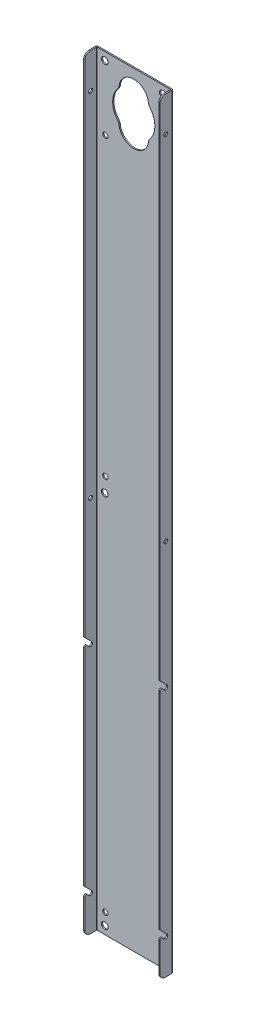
ISO-10303-21;
HEADER;
FILE_DESCRIPTION(('STEP AP214'),'2;1');
FILE_NAME('part.step','',(''),(''),'','','');
FILE_SCHEMA(('AUTOMOTIVE_DESIGN { 1 0 10303 214 1 1 1 1 }'));
ENDSEC;
DATA;
#1=APPLICATION_CONTEXT('core data for automotive mechanical design processes');
#2=APPLICATION_PROTOCOL_DEFINITION('international standard','automotive_design',2000,#1);
#3=PRODUCT_CONTEXT('',#1,'mechanical');
#4=PRODUCT('Part','Part','',(#3));
#5=PRODUCT_RELATED_PRODUCT_CATEGORY('part','',(#4));
#6=PRODUCT_DEFINITION_FORMATION('','',#4);
#7=PRODUCT_DEFINITION_CONTEXT('part definition',#1,'design');
#8=PRODUCT_DEFINITION('design','',#6,#7);
#9=PRODUCT_DEFINITION_SHAPE('','',#8);
#10=(LENGTH_UNIT() NAMED_UNIT(*) SI_UNIT(.MILLI.,.METRE.));
#11=(NAMED_UNIT(*) PLANE_ANGLE_UNIT() SI_UNIT($,.RADIAN.));
#12=(NAMED_UNIT(*) SI_UNIT($,.STERADIAN.) SOLID_ANGLE_UNIT());
#13=UNCERTAINTY_MEASURE_WITH_UNIT(LENGTH_MEASURE(1.E-05),#10,'distance_accuracy_value','');
#14=(GEOMETRIC_REPRESENTATION_CONTEXT(3) GLOBAL_UNCERTAINTY_ASSIGNED_CONTEXT((#13)) GLOBAL_UNIT_ASSIGNED_CONTEXT((#10,
#11,#12)) REPRESENTATION_CONTEXT('',''));
#15=CARTESIAN_POINT('',(0.,0.,0.));
#16=DIRECTION('',(0.,0.,1.));
#17=DIRECTION('',(1.,0.,0.));
#18=AXIS2_PLACEMENT_3D('',#15,#16,#17);
#19=CARTESIAN_POINT('',(-45.9739999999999,-460.375,1.51892));
#20=DIRECTION('',(0.,1.,0.));
#21=DIRECTION('',(0.,0.,1.));
#22=AXIS2_PLACEMENT_3D('',#19,#20,#21);
#23=PLANE('',#22);
#24=DIRECTION('',(0.,0.,-1.));
#25=VECTOR('',#24,1.);
#26=CARTESIAN_POINT('',(-44.2518800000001,-460.375,1.51892000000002));
#27=LINE('',#26,#25);
#28=CARTESIAN_POINT('',(-44.2518800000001,-460.375,1.51892));
#29=VERTEX_POINT('',#28);
#30=CARTESIAN_POINT('',(-44.2518800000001,-460.375,0.));
#31=VERTEX_POINT('',#30);
#32=EDGE_CURVE('E590',#29,#31,#27,.T.);
#33=ORIENTED_EDGE('',*,*,#32,.T.);
#34=DIRECTION('',(1.,0.,0.));
#35=VECTOR('',#34,1.);
#36=CARTESIAN_POINT('',(-45.9739999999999,-460.375,0.));
#37=LINE('',#36,#35);
#38=CARTESIAN_POINT('',(44.2518800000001,-460.375,0.));
#39=VERTEX_POINT('',#38);
#40=EDGE_CURVE('E777',#31,#39,#37,.T.);
#41=ORIENTED_EDGE('',*,*,#40,.T.);
#42=DIRECTION('',(0.,0.,-1.));
#43=VECTOR('',#42,1.);
#44=CARTESIAN_POINT('',(44.2518800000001,-460.375,1.51891999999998));
#45=LINE('',#44,#43);
#46=CARTESIAN_POINT('',(44.2518800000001,-460.375,1.51892));
#47=VERTEX_POINT('',#46);
#48=EDGE_CURVE('E761',#47,#39,#45,.T.);
#49=ORIENTED_EDGE('',*,*,#48,.F.);
#50=DIRECTION('',(1.,0.,0.));
#51=VECTOR('',#50,1.);
#52=CARTESIAN_POINT('',(-45.9739999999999,-460.375,1.51892));
#53=LINE('',#52,#51);
#54=EDGE_CURVE('E778',#29,#47,#53,.T.);
#55=ORIENTED_EDGE('',*,*,#54,.F.);
#56=EDGE_LOOP('',(#33,#41,#49,#55));
#57=FACE_BOUND('',#56,.T.);
#58=ADVANCED_FACE('F181',(#57),#23,.F.);
#59=CARTESIAN_POINT('',(-45.9739999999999,460.375,1.51892));
#60=DIRECTION('',(0.,-1.,0.));
#61=DIRECTION('',(0.,0.,-1.));
#62=AXIS2_PLACEMENT_3D('',#59,#60,#61);
#63=PLANE('',#62);
#64=DIRECTION('',(0.,0.,-1.));
#65=VECTOR('',#64,1.);
#66=CARTESIAN_POINT('',(-43.4924200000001,460.375,1.51892));
#67=LINE('',#66,#65);
#68=CARTESIAN_POINT('',(-43.4924200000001,460.375,1.51892));
#69=VERTEX_POINT('',#68);
#70=CARTESIAN_POINT('',(-43.4924200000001,460.375,0.));
#71=VERTEX_POINT('',#70);
#72=EDGE_CURVE('E607',#69,#71,#67,.T.);
#73=ORIENTED_EDGE('',*,*,#72,.F.);
#74=DIRECTION('',(-1.,0.,0.));
#75=VECTOR('',#74,1.);
#76=CARTESIAN_POINT('',(-45.9739999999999,460.375,1.51892));
#77=LINE('',#76,#75);
#78=CARTESIAN_POINT('',(43.4924200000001,460.375,1.51892));
#79=VERTEX_POINT('',#78);
#80=EDGE_CURVE('E780',#79,#69,#77,.T.);
#81=ORIENTED_EDGE('',*,*,#80,.F.);
#82=DIRECTION('',(0.,0.,1.));
#83=VECTOR('',#82,1.);
#84=CARTESIAN_POINT('',(43.4924200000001,460.375,1.51892));
#85=LINE('',#84,#83);
#86=CARTESIAN_POINT('',(43.4924200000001,460.375,0.));
#87=VERTEX_POINT('',#86);
#88=EDGE_CURVE('E769',#87,#79,#85,.T.);
#89=ORIENTED_EDGE('',*,*,#88,.F.);
#90=DIRECTION('',(-1.,0.,0.));
#91=VECTOR('',#90,1.);
#92=CARTESIAN_POINT('',(-45.9739999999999,460.375,0.));
#93=LINE('',#92,#91);
#94=EDGE_CURVE('E781',#87,#71,#93,.T.);
#95=ORIENTED_EDGE('',*,*,#94,.T.);
#96=EDGE_LOOP('',(#73,#81,#89,#95));
#97=FACE_BOUND('',#96,.T.);
#98=ADVANCED_FACE('F1028',(#97),#63,.F.);
#99=CARTESIAN_POINT('',(0.,0.,1.51892));
#100=DIRECTION('',(0.,0.,1.));
#101=DIRECTION('',(1.,0.,0.));
#102=AXIS2_PLACEMENT_3D('',#99,#100,#101);
#103=PLANE('',#102);
#104=CARTESIAN_POINT('',(34.1629999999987,373.37549181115,1.51892));
#105=DIRECTION('',(0.,0.,1.));
#106=DIRECTION('',(1.,0.,0.));
#107=AXIS2_PLACEMENT_3D('',#104,#105,#106);
#108=CIRCLE('',#107,3.17500000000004);
#109=CARTESIAN_POINT('',(37.3379999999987,373.37549181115,1.51892));
#110=VERTEX_POINT('',#109);
#111=EDGE_CURVE('E855',#110,#110,#108,.T.);
#112=ORIENTED_EDGE('',*,*,#111,.F.);
#113=EDGE_LOOP('',(#112));
#114=FACE_BOUND('',#113,.T.);
#115=CARTESIAN_POINT('',(-34.1629999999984,-436.60042524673,1.51892));
#116=DIRECTION('',(0.,0.,1.));
#117=DIRECTION('',(1.,0.,0.));
#118=AXIS2_PLACEMENT_3D('',#115,#116,#117);
#119=CIRCLE('',#118,3.17499999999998);
#120=CARTESIAN_POINT('',(-30.9879999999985,-436.60042524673,1.51892));
#121=VERTEX_POINT('',#120);
#122=EDGE_CURVE('E861',#121,#121,#119,.T.);
#123=ORIENTED_EDGE('',*,*,#122,.F.);
#124=EDGE_LOOP('',(#123));
#125=FACE_BOUND('',#124,.T.);
#126=CARTESIAN_POINT('',(34.1630000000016,-436.60042524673,1.51892));
#127=DIRECTION('',(0.,0.,1.));
#128=DIRECTION('',(1.,0.,0.));
#129=AXIS2_PLACEMENT_3D('',#126,#127,#128);
#130=CIRCLE('',#129,3.17499999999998);
#131=CARTESIAN_POINT('',(37.3380000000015,-436.60042524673,1.51892));
#132=VERTEX_POINT('',#131);
#133=EDGE_CURVE('E1064',#132,#132,#130,.T.);
#134=ORIENTED_EDGE('',*,*,#133,.F.);
#135=EDGE_LOOP('',(#134));
#136=FACE_BOUND('',#135,.T.);
#137=CARTESIAN_POINT('',(-1.49880108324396E-12,431.160491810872,1.51892));
#138=DIRECTION('',(0.,0.,1.));
#139=DIRECTION('',(1.,0.,0.));
#140=AXIS2_PLACEMENT_3D('',#137,#138,#139);
#141=CIRCLE('',#140,17.7799999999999);
#142=CARTESIAN_POINT('',(17.6952006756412,432.894929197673,1.51892));
#143=VERTEX_POINT('',#142);
#144=CARTESIAN_POINT('',(-17.6952006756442,432.894929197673,1.51892));
#145=VERTEX_POINT('',#144);
#146=EDGE_CURVE('E842',#143,#145,#141,.T.);
#147=ORIENTED_EDGE('',*,*,#146,.F.);
#148=CARTESIAN_POINT('',(24.0149152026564,433.514371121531,1.51892));
#149=DIRECTION('',(0.,0.,1.));
#150=DIRECTION('',(1.,0.,0.));
#151=AXIS2_PLACEMENT_3D('',#148,#149,#150);
#152=CIRCLE('',#151,6.35);
#153=CARTESIAN_POINT('',(19.2119321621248,429.360595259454,1.51892));
#154=VERTEX_POINT('',#153);
#155=EDGE_CURVE('E810',#143,#154,#152,.T.);
#156=ORIENTED_EDGE('',*,*,#155,.T.);
#157=CARTESIAN_POINT('',(-1.4432899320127E-12,412.74549181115,1.51892));
#158=DIRECTION('',(0.,0.,1.));
#159=DIRECTION('',(1.,0.,0.));
#160=AXIS2_PLACEMENT_3D('',#157,#158,#159);
#161=CIRCLE('',#160,25.4);
#162=CARTESIAN_POINT('',(19.211932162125,396.130388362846,1.51892));
#163=VERTEX_POINT('',#162);
#164=EDGE_CURVE('E847',#163,#154,#161,.T.);
#165=ORIENTED_EDGE('',*,*,#164,.F.);
#166=CARTESIAN_POINT('',(24.0149152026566,391.97661250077,1.51892));
#167=DIRECTION('',(0.,0.,1.));
#168=DIRECTION('',(1.,0.,0.));
#169=AXIS2_PLACEMENT_3D('',#166,#167,#168);
#170=CIRCLE('',#169,6.35);
#171=CARTESIAN_POINT('',(17.6952006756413,392.596054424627,1.51892));
#172=VERTEX_POINT('',#171);
#173=EDGE_CURVE('E808',#163,#172,#170,.T.);
#174=ORIENTED_EDGE('',*,*,#173,.T.);
#175=CARTESIAN_POINT('',(-1.38777878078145E-12,394.330491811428,1.51892));
#176=DIRECTION('',(0.,0.,1.));
#177=DIRECTION('',(1.,0.,0.));
#178=AXIS2_PLACEMENT_3D('',#175,#176,#177);
#179=CIRCLE('',#178,17.78);
#180=CARTESIAN_POINT('',(-17.6952006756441,392.596054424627,1.51892));
#181=VERTEX_POINT('',#180);
#182=EDGE_CURVE('E841',#181,#172,#179,.T.);
#183=ORIENTED_EDGE('',*,*,#182,.F.);
#184=CARTESIAN_POINT('',(-24.0149152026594,391.97661250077,1.51892));
#185=DIRECTION('',(0.,0.,1.));
#186=DIRECTION('',(1.,0.,0.));
#187=AXIS2_PLACEMENT_3D('',#184,#185,#186);
#188=CIRCLE('',#187,6.35);
#189=CARTESIAN_POINT('',(-19.2119321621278,396.130388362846,1.51892));
#190=VERTEX_POINT('',#189);
#191=EDGE_CURVE('E806',#181,#190,#188,.T.);
#192=ORIENTED_EDGE('',*,*,#191,.T.);
#193=CARTESIAN_POINT('',(-1.4432899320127E-12,412.74549181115,1.51892));
#194=DIRECTION('',(0.,0.,1.));
#195=DIRECTION('',(1.,0.,0.));
#196=AXIS2_PLACEMENT_3D('',#193,#194,#195);
#197=CIRCLE('',#196,25.4);
#198=CARTESIAN_POINT('',(-19.2119321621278,429.360595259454,1.51892));
#199=VERTEX_POINT('',#198);
#200=EDGE_CURVE('E832',#199,#190,#197,.T.);
#201=ORIENTED_EDGE('',*,*,#200,.F.);
#202=CARTESIAN_POINT('',(-24.0149152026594,433.51437112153,1.51892));
#203=DIRECTION('',(0.,0.,1.));
#204=DIRECTION('',(1.,0.,0.));
#205=AXIS2_PLACEMENT_3D('',#202,#203,#204);
#206=CIRCLE('',#205,6.35);
#207=EDGE_CURVE('E804',#199,#145,#206,.T.);
#208=ORIENTED_EDGE('',*,*,#207,.T.);
#209=EDGE_LOOP('',(#147,#156,#165,#174,#183,#192,#201,#208));
#210=FACE_BOUND('',#209,.T.);
#211=CARTESIAN_POINT('',(34.9249999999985,450.84373495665,1.51892));
#212=DIRECTION('',(0.,0.,1.));
#213=DIRECTION('',(1.,0.,0.));
#214=AXIS2_PLACEMENT_3D('',#211,#212,#213);
#215=CIRCLE('',#214,3.96240000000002);
#216=CARTESIAN_POINT('',(38.8873999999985,450.84373495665,1.51892));
#217=VERTEX_POINT('',#216);
#218=EDGE_CURVE('E881',#217,#217,#215,.T.);
#219=ORIENTED_EDGE('',*,*,#218,.F.);
#220=EDGE_LOOP('',(#219));
#221=FACE_BOUND('',#220,.T.);
#222=CARTESIAN_POINT('',(-34.9249999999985,-450.85626504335,1.51892));
#223=DIRECTION('',(0.,0.,1.));
#224=DIRECTION('',(1.,0.,0.));
#225=AXIS2_PLACEMENT_3D('',#222,#223,#224);
#226=CIRCLE('',#225,3.96240000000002);
#227=CARTESIAN_POINT('',(-30.9625999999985,-450.85626504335,1.51892));
#228=VERTEX_POINT('',#227);
#229=EDGE_CURVE('E868',#228,#228,#226,.T.);
#230=ORIENTED_EDGE('',*,*,#229,.F.);
#231=EDGE_LOOP('',(#230));
#232=FACE_BOUND('',#231,.T.);
#233=CARTESIAN_POINT('',(34.9250000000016,-450.84373495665,1.51892));
#234=DIRECTION('',(0.,0.,1.));
#235=DIRECTION('',(1.,0.,0.));
#236=AXIS2_PLACEMENT_3D('',#233,#234,#235);
#237=CIRCLE('',#236,3.96240000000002);
#238=CARTESIAN_POINT('',(38.8874000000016,-450.84373495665,1.51892));
#239=VERTEX_POINT('',#238);
#240=EDGE_CURVE('E869',#239,#239,#237,.T.);
#241=ORIENTED_EDGE('',*,*,#240,.F.);
#242=EDGE_LOOP('',(#241));
#243=FACE_BOUND('',#242,.T.);
#244=CARTESIAN_POINT('',(-34.1630000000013,373.37549181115,1.51892));
#245=DIRECTION('',(0.,0.,1.));
#246=DIRECTION('',(1.,0.,0.));
#247=AXIS2_PLACEMENT_3D('',#244,#245,#246);
#248=CIRCLE('',#247,3.17500000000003);
#249=CARTESIAN_POINT('',(-30.9880000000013,373.37549181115,1.51892));
#250=VERTEX_POINT('',#249);
#251=EDGE_CURVE('E854',#250,#250,#248,.T.);
#252=ORIENTED_EDGE('',*,*,#251,.F.);
#253=EDGE_LOOP('',(#252));
#254=FACE_BOUND('',#253,.T.);
#255=CARTESIAN_POINT('',(-34.925,-1.27010901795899E-09,1.51892));
#256=DIRECTION('',(0.,0.,1.));
#257=DIRECTION('',(1.,0.,0.));
#258=AXIS2_PLACEMENT_3D('',#255,#256,#257);
#259=CIRCLE('',#258,3.96240000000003);
#260=CARTESIAN_POINT('',(-30.9626,-1.27010901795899E-09,1.51892));
#261=VERTEX_POINT('',#260);
#262=EDGE_CURVE('E1077',#261,#261,#259,.T.);
#263=ORIENTED_EDGE('',*,*,#262,.F.);
#264=EDGE_LOOP('',(#263));
#265=FACE_BOUND('',#264,.T.);
#266=CARTESIAN_POINT('',(34.925,-0.0125300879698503,1.51892));
#267=DIRECTION('',(0.,0.,1.));
#268=DIRECTION('',(1.,0.,0.));
#269=AXIS2_PLACEMENT_3D('',#266,#267,#268);
#270=CIRCLE('',#269,3.96240000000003);
#271=CARTESIAN_POINT('',(38.8874000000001,-0.0125300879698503,1.51892));
#272=VERTEX_POINT('',#271);
#273=EDGE_CURVE('E1087',#272,#272,#270,.T.);
#274=ORIENTED_EDGE('',*,*,#273,.F.);
#275=EDGE_LOOP('',(#274));
#276=FACE_BOUND('',#275,.T.);
#277=CARTESIAN_POINT('',(-34.1630000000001,17.7671559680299,1.51892));
#278=DIRECTION('',(0.,0.,1.));
#279=DIRECTION('',(1.,0.,0.));
#280=AXIS2_PLACEMENT_3D('',#277,#278,#279);
#281=CIRCLE('',#280,3.17500000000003);
#282=CARTESIAN_POINT('',(-30.988,17.7671559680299,1.51892));
#283=VERTEX_POINT('',#282);
#284=EDGE_CURVE('E1093',#283,#283,#281,.T.);
#285=ORIENTED_EDGE('',*,*,#284,.F.);
#286=EDGE_LOOP('',(#285));
#287=FACE_BOUND('',#286,.T.);
#288=CARTESIAN_POINT('',(34.1629999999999,17.7671559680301,1.51892));
#289=DIRECTION('',(0.,0.,1.));
#290=DIRECTION('',(1.,0.,0.));
#291=AXIS2_PLACEMENT_3D('',#288,#289,#290);
#292=CIRCLE('',#291,3.17500000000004);
#293=CARTESIAN_POINT('',(37.338,17.7671559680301,1.51892));
#294=VERTEX_POINT('',#293);
#295=EDGE_CURVE('E1099',#294,#294,#292,.T.);
#296=ORIENTED_EDGE('',*,*,#295,.F.);
#297=EDGE_LOOP('',(#296));
#298=FACE_BOUND('',#297,.T.);
#299=CARTESIAN_POINT('',(-34.9250000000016,450.85626504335,1.51892));
#300=DIRECTION('',(0.,0.,1.));
#301=DIRECTION('',(1.,0.,0.));
#302=AXIS2_PLACEMENT_3D('',#299,#300,#301);
#303=CIRCLE('',#302,3.96240000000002);
#304=CARTESIAN_POINT('',(-30.9626000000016,450.85626504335,1.51892));
#305=VERTEX_POINT('',#304);
#306=EDGE_CURVE('E880',#305,#305,#303,.T.);
#307=ORIENTED_EDGE('',*,*,#306,.F.);
#308=EDGE_LOOP('',(#307));
#309=FACE_BOUND('',#308,.T.);
#310=DIRECTION('',(1.,0.,0.));
#311=VECTOR('',#310,1.);
#312=CARTESIAN_POINT('',(-44.2518800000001,460.27863230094,1.51892000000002));
#313=LINE('',#312,#311);
#314=CARTESIAN_POINT('',(-44.2518800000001,460.27863230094,1.51892));
#315=VERTEX_POINT('',#314);
#316=CARTESIAN_POINT('',(-43.4924200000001,460.27863230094,1.51892));
#317=VERTEX_POINT('',#316);
#318=EDGE_CURVE('E604',#315,#317,#313,.T.);
#319=ORIENTED_EDGE('',*,*,#318,.F.);
#320=DIRECTION('',(0.,-1.,0.));
#321=VECTOR('',#320,1.);
#322=CARTESIAN_POINT('',(-44.2518800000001,-460.375,1.51892000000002));
#323=LINE('',#322,#321);
#324=EDGE_CURVE('E594',#29,#315,#323,.F.);
#325=ORIENTED_EDGE('',*,*,#324,.F.);
#326=ORIENTED_EDGE('',*,*,#54,.T.);
#327=DIRECTION('',(0.,1.,0.));
#328=VECTOR('',#327,1.);
#329=CARTESIAN_POINT('',(44.2518800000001,460.27863230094,1.51891999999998));
#330=LINE('',#329,#328);
#331=CARTESIAN_POINT('',(44.2518800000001,460.27863230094,1.51892));
#332=VERTEX_POINT('',#331);
#333=EDGE_CURVE('E756',#332,#47,#330,.F.);
#334=ORIENTED_EDGE('',*,*,#333,.F.);
#335=DIRECTION('',(1.,0.,0.));
#336=VECTOR('',#335,1.);
#337=CARTESIAN_POINT('',(43.4924200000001,460.27863230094,1.51891999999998));
#338=LINE('',#337,#336);
#339=CARTESIAN_POINT('',(43.4924200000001,460.27863230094,1.51892));
#340=VERTEX_POINT('',#339);
#341=EDGE_CURVE('E770',#340,#332,#338,.T.);
#342=ORIENTED_EDGE('',*,*,#341,.F.);
#343=DIRECTION('',(0.,-1.,0.));
#344=VECTOR('',#343,1.);
#345=CARTESIAN_POINT('',(43.4924200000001,461.03809230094,1.51891999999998));
#346=LINE('',#345,#344);
#347=EDGE_CURVE('E766',#79,#340,#346,.T.);
#348=ORIENTED_EDGE('',*,*,#347,.F.);
#349=ORIENTED_EDGE('',*,*,#80,.T.);
#350=DIRECTION('',(0.,1.,0.));
#351=VECTOR('',#350,1.);
#352=CARTESIAN_POINT('',(-43.4924200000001,460.27863230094,1.51892000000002));
#353=LINE('',#352,#351);
#354=EDGE_CURVE('E608',#317,#69,#353,.T.);
#355=ORIENTED_EDGE('',*,*,#354,.F.);
#356=EDGE_LOOP('',(#319,#325,#326,#334,#342,#348,#349,#355));
#357=FACE_BOUND('',#356,.T.);
#358=ADVANCED_FACE('F837',(#114,#125,#136,#210,#221,#232,#243,#254,#265,#276,#287,#298,#309,
#357),#103,.T.);
#359=CARTESIAN_POINT('',(0.,0.,0.));
#360=DIRECTION('',(0.,0.,1.));
#361=DIRECTION('',(1.,0.,0.));
#362=AXIS2_PLACEMENT_3D('',#359,#360,#361);
#363=PLANE('',#362);
#364=CARTESIAN_POINT('',(34.1629999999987,373.37549181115,0.));
#365=DIRECTION('',(0.,0.,1.));
#366=DIRECTION('',(1.,0.,0.));
#367=AXIS2_PLACEMENT_3D('',#364,#365,#366);
#368=CIRCLE('',#367,3.17500000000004);
#369=CARTESIAN_POINT('',(37.3379999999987,373.37549181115,0.));
#370=VERTEX_POINT('',#369);
#371=EDGE_CURVE('E851',#370,#370,#368,.T.);
#372=ORIENTED_EDGE('',*,*,#371,.T.);
#373=EDGE_LOOP('',(#372));
#374=FACE_BOUND('',#373,.T.);
#375=CARTESIAN_POINT('',(-34.1629999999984,-436.60042524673,0.));
#376=DIRECTION('',(0.,0.,1.));
#377=DIRECTION('',(1.,0.,0.));
#378=AXIS2_PLACEMENT_3D('',#375,#376,#377);
#379=CIRCLE('',#378,3.17499999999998);
#380=CARTESIAN_POINT('',(-30.9879999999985,-436.60042524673,0.));
#381=VERTEX_POINT('',#380);
#382=EDGE_CURVE('E858',#381,#381,#379,.T.);
#383=ORIENTED_EDGE('',*,*,#382,.T.);
#384=EDGE_LOOP('',(#383));
#385=FACE_BOUND('',#384,.T.);
#386=CARTESIAN_POINT('',(34.1630000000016,-436.60042524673,0.));
#387=DIRECTION('',(0.,0.,1.));
#388=DIRECTION('',(1.,0.,0.));
#389=AXIS2_PLACEMENT_3D('',#386,#387,#388);
#390=CIRCLE('',#389,3.17499999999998);
#391=CARTESIAN_POINT('',(37.3380000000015,-436.60042524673,0.));
#392=VERTEX_POINT('',#391);
#393=EDGE_CURVE('E864',#392,#392,#390,.T.);
#394=ORIENTED_EDGE('',*,*,#393,.T.);
#395=EDGE_LOOP('',(#394));
#396=FACE_BOUND('',#395,.T.);
#397=CARTESIAN_POINT('',(-1.4432899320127E-12,412.74549181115,0.));
#398=DIRECTION('',(0.,0.,1.));
#399=DIRECTION('',(1.,0.,0.));
#400=AXIS2_PLACEMENT_3D('',#397,#398,#399);
#401=CIRCLE('',#400,25.4);
#402=CARTESIAN_POINT('',(19.211932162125,396.130388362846,0.));
#403=VERTEX_POINT('',#402);
#404=CARTESIAN_POINT('',(19.2119321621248,429.360595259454,0.));
#405=VERTEX_POINT('',#404);
#406=EDGE_CURVE('E845',#403,#405,#401,.T.);
#407=ORIENTED_EDGE('',*,*,#406,.T.);
#408=CARTESIAN_POINT('',(24.0149152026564,433.514371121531,0.));
#409=DIRECTION('',(0.,0.,1.));
#410=DIRECTION('',(1.,0.,0.));
#411=AXIS2_PLACEMENT_3D('',#408,#409,#410);
#412=CIRCLE('',#411,6.35);
#413=CARTESIAN_POINT('',(17.6952006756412,432.894929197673,0.));
#414=VERTEX_POINT('',#413);
#415=EDGE_CURVE('E822',#405,#414,#412,.F.);
#416=ORIENTED_EDGE('',*,*,#415,.T.);
#417=CARTESIAN_POINT('',(-1.49880108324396E-12,431.160491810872,0.));
#418=DIRECTION('',(0.,0.,1.));
#419=DIRECTION('',(1.,0.,0.));
#420=AXIS2_PLACEMENT_3D('',#417,#418,#419);
#421=CIRCLE('',#420,17.7799999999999);
#422=CARTESIAN_POINT('',(-17.6952006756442,432.894929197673,0.));
#423=VERTEX_POINT('',#422);
#424=EDGE_CURVE('E1068',#414,#423,#421,.T.);
#425=ORIENTED_EDGE('',*,*,#424,.T.);
#426=CARTESIAN_POINT('',(-24.0149152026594,433.51437112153,0.));
#427=DIRECTION('',(0.,0.,1.));
#428=DIRECTION('',(1.,0.,0.));
#429=AXIS2_PLACEMENT_3D('',#426,#427,#428);
#430=CIRCLE('',#429,6.35);
#431=CARTESIAN_POINT('',(-19.2119321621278,429.360595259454,0.));
#432=VERTEX_POINT('',#431);
#433=EDGE_CURVE('E201',#423,#432,#430,.F.);
#434=ORIENTED_EDGE('',*,*,#433,.T.);
#435=CARTESIAN_POINT('',(-1.4432899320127E-12,412.74549181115,0.));
#436=DIRECTION('',(0.,0.,1.));
#437=DIRECTION('',(1.,0.,0.));
#438=AXIS2_PLACEMENT_3D('',#435,#436,#437);
#439=CIRCLE('',#438,25.4);
#440=CARTESIAN_POINT('',(-19.2119321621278,396.130388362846,0.));
#441=VERTEX_POINT('',#440);
#442=EDGE_CURVE('E833',#432,#441,#439,.T.);
#443=ORIENTED_EDGE('',*,*,#442,.T.);
#444=CARTESIAN_POINT('',(-24.0149152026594,391.97661250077,0.));
#445=DIRECTION('',(0.,0.,1.));
#446=DIRECTION('',(1.,0.,0.));
#447=AXIS2_PLACEMENT_3D('',#444,#445,#446);
#448=CIRCLE('',#447,6.35);
#449=CARTESIAN_POINT('',(-17.6952006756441,392.596054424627,0.));
#450=VERTEX_POINT('',#449);
#451=EDGE_CURVE('E818',#441,#450,#448,.F.);
#452=ORIENTED_EDGE('',*,*,#451,.T.);
#453=CARTESIAN_POINT('',(-1.38777878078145E-12,394.330491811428,0.));
#454=DIRECTION('',(0.,0.,1.));
#455=DIRECTION('',(1.,0.,0.));
#456=AXIS2_PLACEMENT_3D('',#453,#454,#455);
#457=CIRCLE('',#456,17.78);
#458=CARTESIAN_POINT('',(17.6952006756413,392.596054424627,0.));
#459=VERTEX_POINT('',#458);
#460=EDGE_CURVE('E1059',#450,#459,#457,.T.);
#461=ORIENTED_EDGE('',*,*,#460,.T.);
#462=CARTESIAN_POINT('',(24.0149152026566,391.97661250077,0.));
#463=DIRECTION('',(0.,0.,1.));
#464=DIRECTION('',(1.,0.,0.));
#465=AXIS2_PLACEMENT_3D('',#462,#463,#464);
#466=CIRCLE('',#465,6.35);
#467=EDGE_CURVE('E820',#459,#403,#466,.F.);
#468=ORIENTED_EDGE('',*,*,#467,.T.);
#469=EDGE_LOOP('',(#407,#416,#425,#434,#443,#452,#461,#468));
#470=FACE_BOUND('',#469,.T.);
#471=CARTESIAN_POINT('',(34.9249999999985,450.84373495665,0.));
#472=DIRECTION('',(0.,0.,1.));
#473=DIRECTION('',(1.,0.,0.));
#474=AXIS2_PLACEMENT_3D('',#471,#472,#473);
#475=CIRCLE('',#474,3.96240000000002);
#476=CARTESIAN_POINT('',(38.8873999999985,450.84373495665,0.));
#477=VERTEX_POINT('',#476);
#478=EDGE_CURVE('E877',#477,#477,#475,.T.);
#479=ORIENTED_EDGE('',*,*,#478,.T.);
#480=EDGE_LOOP('',(#479));
#481=FACE_BOUND('',#480,.T.);
#482=CARTESIAN_POINT('',(-34.9249999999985,-450.85626504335,0.));
#483=DIRECTION('',(0.,0.,1.));
#484=DIRECTION('',(1.,0.,0.));
#485=AXIS2_PLACEMENT_3D('',#482,#483,#484);
#486=CIRCLE('',#485,3.96240000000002);
#487=CARTESIAN_POINT('',(-30.9625999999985,-450.85626504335,0.));
#488=VERTEX_POINT('',#487);
#489=EDGE_CURVE('E884',#488,#488,#486,.T.);
#490=ORIENTED_EDGE('',*,*,#489,.T.);
#491=EDGE_LOOP('',(#490));
#492=FACE_BOUND('',#491,.T.);
#493=CARTESIAN_POINT('',(34.9250000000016,-450.84373495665,0.));
#494=DIRECTION('',(0.,0.,1.));
#495=DIRECTION('',(1.,0.,0.));
#496=AXIS2_PLACEMENT_3D('',#493,#494,#495);
#497=CIRCLE('',#496,3.96240000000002);
#498=CARTESIAN_POINT('',(38.8874000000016,-450.84373495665,0.));
#499=VERTEX_POINT('',#498);
#500=EDGE_CURVE('E865',#499,#499,#497,.T.);
#501=ORIENTED_EDGE('',*,*,#500,.T.);
#502=EDGE_LOOP('',(#501));
#503=FACE_BOUND('',#502,.T.);
#504=CARTESIAN_POINT('',(-34.1630000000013,373.37549181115,0.));
#505=DIRECTION('',(0.,0.,1.));
#506=DIRECTION('',(1.,0.,0.));
#507=AXIS2_PLACEMENT_3D('',#504,#505,#506);
#508=CIRCLE('',#507,3.17500000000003);
#509=CARTESIAN_POINT('',(-30.9880000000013,373.37549181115,0.));
#510=VERTEX_POINT('',#509);
#511=EDGE_CURVE('E872',#510,#510,#508,.T.);
#512=ORIENTED_EDGE('',*,*,#511,.T.);
#513=EDGE_LOOP('',(#512));
#514=FACE_BOUND('',#513,.T.);
#515=CARTESIAN_POINT('',(-34.925,-1.27010901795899E-09,0.));
#516=DIRECTION('',(0.,0.,1.));
#517=DIRECTION('',(1.,0.,0.));
#518=AXIS2_PLACEMENT_3D('',#515,#516,#517);
#519=CIRCLE('',#518,3.96240000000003);
#520=CARTESIAN_POINT('',(-30.9626,-1.27010901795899E-09,0.));
#521=VERTEX_POINT('',#520);
#522=EDGE_CURVE('E1072',#521,#521,#519,.T.);
#523=ORIENTED_EDGE('',*,*,#522,.T.);
#524=EDGE_LOOP('',(#523));
#525=FACE_BOUND('',#524,.T.);
#526=CARTESIAN_POINT('',(34.925,-0.0125300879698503,0.));
#527=DIRECTION('',(0.,0.,1.));
#528=DIRECTION('',(1.,0.,0.));
#529=AXIS2_PLACEMENT_3D('',#526,#527,#528);
#530=CIRCLE('',#529,3.96240000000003);
#531=CARTESIAN_POINT('',(38.8874000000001,-0.0125300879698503,0.));
#532=VERTEX_POINT('',#531);
#533=EDGE_CURVE('E1082',#532,#532,#530,.T.);
#534=ORIENTED_EDGE('',*,*,#533,.T.);
#535=EDGE_LOOP('',(#534));
#536=FACE_BOUND('',#535,.T.);
#537=CARTESIAN_POINT('',(-34.1630000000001,17.7671559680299,0.));
#538=DIRECTION('',(0.,0.,1.));
#539=DIRECTION('',(1.,0.,0.));
#540=AXIS2_PLACEMENT_3D('',#537,#538,#539);
#541=CIRCLE('',#540,3.17500000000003);
#542=CARTESIAN_POINT('',(-30.988,17.7671559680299,0.));
#543=VERTEX_POINT('',#542);
#544=EDGE_CURVE('E1090',#543,#543,#541,.T.);
#545=ORIENTED_EDGE('',*,*,#544,.T.);
#546=EDGE_LOOP('',(#545));
#547=FACE_BOUND('',#546,.T.);
#548=CARTESIAN_POINT('',(34.1629999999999,17.7671559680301,0.));
#549=DIRECTION('',(0.,0.,1.));
#550=DIRECTION('',(1.,0.,0.));
#551=AXIS2_PLACEMENT_3D('',#548,#549,#550);
#552=CIRCLE('',#551,3.17500000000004);
#553=CARTESIAN_POINT('',(37.338,17.7671559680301,0.));
#554=VERTEX_POINT('',#553);
#555=EDGE_CURVE('E1096',#554,#554,#552,.T.);
#556=ORIENTED_EDGE('',*,*,#555,.T.);
#557=EDGE_LOOP('',(#556));
#558=FACE_BOUND('',#557,.T.);
#559=CARTESIAN_POINT('',(-34.9250000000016,450.85626504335,0.));
#560=DIRECTION('',(0.,0.,1.));
#561=DIRECTION('',(1.,0.,0.));
#562=AXIS2_PLACEMENT_3D('',#559,#560,#561);
#563=CIRCLE('',#562,3.96240000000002);
#564=CARTESIAN_POINT('',(-30.9626000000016,450.85626504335,0.));
#565=VERTEX_POINT('',#564);
#566=EDGE_CURVE('E587',#565,#565,#563,.T.);
#567=ORIENTED_EDGE('',*,*,#566,.T.);
#568=EDGE_LOOP('',(#567));
#569=FACE_BOUND('',#568,.T.);
#570=DIRECTION('',(0.,-1.,0.));
#571=VECTOR('',#570,1.);
#572=CARTESIAN_POINT('',(-44.2518800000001,-460.375,0.));
#573=LINE('',#572,#571);
#574=CARTESIAN_POINT('',(-44.2518800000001,460.27863230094,0.));
#575=VERTEX_POINT('',#574);
#576=EDGE_CURVE('E493',#31,#575,#573,.F.);
#577=ORIENTED_EDGE('',*,*,#576,.T.);
#578=DIRECTION('',(-1.,0.,0.));
#579=VECTOR('',#578,1.);
#580=CARTESIAN_POINT('',(0.,460.27863230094,0.));
#581=LINE('',#580,#579);
#582=CARTESIAN_POINT('',(-43.4924200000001,460.27863230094,0.));
#583=VERTEX_POINT('',#582);
#584=EDGE_CURVE('E796',#583,#575,#581,.T.);
#585=ORIENTED_EDGE('',*,*,#584,.F.);
#586=DIRECTION('',(0.,-1.,0.));
#587=VECTOR('',#586,1.);
#588=CARTESIAN_POINT('',(-43.4924200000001,0.,0.));
#589=LINE('',#588,#587);
#590=EDGE_CURVE('E793',#71,#583,#589,.T.);
#591=ORIENTED_EDGE('',*,*,#590,.F.);
#592=ORIENTED_EDGE('',*,*,#94,.F.);
#593=DIRECTION('',(0.,1.,0.));
#594=VECTOR('',#593,1.);
#595=CARTESIAN_POINT('',(43.4924200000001,0.,0.));
#596=LINE('',#595,#594);
#597=CARTESIAN_POINT('',(43.4924200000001,460.27863230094,0.));
#598=VERTEX_POINT('',#597);
#599=EDGE_CURVE('E790',#598,#87,#596,.T.);
#600=ORIENTED_EDGE('',*,*,#599,.F.);
#601=DIRECTION('',(-1.,0.,0.));
#602=VECTOR('',#601,1.);
#603=CARTESIAN_POINT('',(0.,460.27863230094,0.));
#604=LINE('',#603,#602);
#605=CARTESIAN_POINT('',(44.2518800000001,460.27863230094,0.));
#606=VERTEX_POINT('',#605);
#607=EDGE_CURVE('E784',#606,#598,#604,.T.);
#608=ORIENTED_EDGE('',*,*,#607,.F.);
#609=DIRECTION('',(0.,1.,0.));
#610=VECTOR('',#609,1.);
#611=CARTESIAN_POINT('',(44.2518800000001,460.27863230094,0.));
#612=LINE('',#611,#610);
#613=EDGE_CURVE('E743',#606,#39,#612,.F.);
#614=ORIENTED_EDGE('',*,*,#613,.T.);
#615=ORIENTED_EDGE('',*,*,#40,.F.);
#616=EDGE_LOOP('',(#577,#585,#591,#592,#600,#608,#614,#615));
#617=FACE_BOUND('',#616,.T.);
#618=ADVANCED_FACE('F1057',(#374,#385,#396,#470,#481,#492,#503,#514,#525,#536,#547,#558,#569,
#617),#363,.F.);
#619=CARTESIAN_POINT('',(43.4924200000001,461.03809230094,1.51891999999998));
#620=DIRECTION('',(1.,0.,0.));
#621=DIRECTION('',(0.,0.,-1.));
#622=AXIS2_PLACEMENT_3D('',#619,#620,#621);
#623=PLANE('',#622);
#624=ORIENTED_EDGE('',*,*,#599,.T.);
#625=ORIENTED_EDGE('',*,*,#88,.T.);
#626=ORIENTED_EDGE('',*,*,#347,.T.);
#627=DIRECTION('',(0.,0.,-1.));
#628=VECTOR('',#627,1.);
#629=CARTESIAN_POINT('',(43.4924200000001,460.27863230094,1.51891999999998));
#630=LINE('',#629,#628);
#631=EDGE_CURVE('E764',#340,#598,#630,.T.);
#632=ORIENTED_EDGE('',*,*,#631,.T.);
#633=EDGE_LOOP('',(#624,#625,#626,#632));
#634=FACE_BOUND('',#633,.T.);
#635=ADVANCED_FACE('F1336',(#634),#623,.T.);
#636=CARTESIAN_POINT('',(43.4924200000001,460.27863230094,1.51891999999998));
#637=DIRECTION('',(0.,1.,0.));
#638=DIRECTION('',(0.,0.,1.));
#639=AXIS2_PLACEMENT_3D('',#636,#637,#638);
#640=PLANE('',#639);
#641=DIRECTION('',(0.,0.,-1.));
#642=VECTOR('',#641,1.);
#643=CARTESIAN_POINT('',(44.2518800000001,460.27863230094,1.51891999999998));
#644=LINE('',#643,#642);
#645=EDGE_CURVE('E750',#332,#606,#644,.T.);
#646=ORIENTED_EDGE('',*,*,#645,.T.);
#647=ORIENTED_EDGE('',*,*,#607,.T.);
#648=ORIENTED_EDGE('',*,*,#631,.F.);
#649=ORIENTED_EDGE('',*,*,#341,.T.);
#650=EDGE_LOOP('',(#646,#647,#648,#649));
#651=FACE_BOUND('',#650,.T.);
#652=ADVANCED_FACE('F1806',(#651),#640,.T.);
#653=CARTESIAN_POINT('',(44.2518800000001,-460.375,1.72211999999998));
#654=DIRECTION('',(0.,-1.,0.));
#655=DIRECTION('',(0.,0.,-1.));
#656=AXIS2_PLACEMENT_3D('',#653,#654,#655);
#657=PLANE('',#656);
#658=DIRECTION('',(-1.,0.,0.));
#659=VECTOR('',#658,1.);
#660=CARTESIAN_POINT('',(45.9740000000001,-460.375,1.72212));
#661=LINE('',#660,#659);
#662=CARTESIAN_POINT('',(44.4550800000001,-460.375,1.72211999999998));
#663=VERTEX_POINT('',#662);
#664=CARTESIAN_POINT('',(45.9740000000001,-460.375,1.72211999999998));
#665=VERTEX_POINT('',#664);
#666=EDGE_CURVE('E615',#663,#665,#661,.F.);
#667=ORIENTED_EDGE('',*,*,#666,.F.);
#668=CARTESIAN_POINT('',(44.2518800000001,-460.375,1.72211999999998));
#669=DIRECTION('',(0.,1.,0.));
#670=DIRECTION('',(0.,0.,1.));
#671=AXIS2_PLACEMENT_3D('',#668,#669,#670);
#672=CIRCLE('',#671,0.203200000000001);
#673=EDGE_CURVE('E753',#47,#663,#672,.F.);
#674=ORIENTED_EDGE('',*,*,#673,.F.);
#675=ORIENTED_EDGE('',*,*,#48,.T.);
#676=CARTESIAN_POINT('',(44.2518800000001,-460.375,1.72211999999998));
#677=DIRECTION('',(0.,1.,0.));
#678=DIRECTION('',(0.,0.,1.));
#679=AXIS2_PLACEMENT_3D('',#676,#677,#678);
#680=CIRCLE('',#679,1.72212);
#681=EDGE_CURVE('E746',#39,#665,#680,.F.);
#682=ORIENTED_EDGE('',*,*,#681,.T.);
#683=EDGE_LOOP('',(#667,#674,#675,#682));
#684=FACE_BOUND('',#683,.T.);
#685=ADVANCED_FACE('F1796',(#684),#657,.T.);
#686=CARTESIAN_POINT('',(44.2518800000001,460.27863230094,1.72211999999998));
#687=DIRECTION('',(0.,-1.,0.));
#688=DIRECTION('',(0.,0.,-1.));
#689=AXIS2_PLACEMENT_3D('',#686,#687,#688);
#690=PLANE('',#689);
#691=CARTESIAN_POINT('',(44.2518800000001,460.27863230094,1.72211999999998));
#692=DIRECTION('',(0.,1.,0.));
#693=DIRECTION('',(0.,0.,1.));
#694=AXIS2_PLACEMENT_3D('',#691,#692,#693);
#695=CIRCLE('',#694,0.203200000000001);
#696=CARTESIAN_POINT('',(44.4550800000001,460.27863230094,1.72211999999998));
#697=VERTEX_POINT('',#696);
#698=EDGE_CURVE('E655',#697,#332,#695,.T.);
#699=ORIENTED_EDGE('',*,*,#698,.F.);
#700=DIRECTION('',(-1.,0.,0.));
#701=VECTOR('',#700,1.);
#702=CARTESIAN_POINT('',(44.4550800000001,460.27863230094,1.72211999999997));
#703=LINE('',#702,#701);
#704=CARTESIAN_POINT('',(45.9740000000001,460.27863230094,1.72211999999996));
#705=VERTEX_POINT('',#704);
#706=EDGE_CURVE('E736',#697,#705,#703,.F.);
#707=ORIENTED_EDGE('',*,*,#706,.T.);
#708=CARTESIAN_POINT('',(44.2518800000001,460.27863230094,1.72211999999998));
#709=DIRECTION('',(0.,1.,0.));
#710=DIRECTION('',(0.,0.,1.));
#711=AXIS2_PLACEMENT_3D('',#708,#709,#710);
#712=CIRCLE('',#711,1.72212);
#713=EDGE_CURVE('E747',#705,#606,#712,.T.);
#714=ORIENTED_EDGE('',*,*,#713,.T.);
#715=ORIENTED_EDGE('',*,*,#645,.F.);
#716=EDGE_LOOP('',(#699,#707,#714,#715));
#717=FACE_BOUND('',#716,.T.);
#718=ADVANCED_FACE('F1786',(#717),#690,.F.);
#719=CARTESIAN_POINT('',(44.2518800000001,460.27863230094,1.72211999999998));
#720=DIRECTION('',(0.,1.,0.));
#721=DIRECTION('',(1.,0.,0.));
#722=AXIS2_PLACEMENT_3D('',#719,#720,#721);
#723=CYLINDRICAL_SURFACE('',#722,1.72212);
#724=ORIENTED_EDGE('',*,*,#613,.F.);
#725=ORIENTED_EDGE('',*,*,#713,.F.);
#726=DIRECTION('',(0.,1.,0.));
#727=VECTOR('',#726,1.);
#728=CARTESIAN_POINT('',(45.9740000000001,-454.025,1.72212));
#729=LINE('',#728,#727);
#730=EDGE_CURVE('E733',#665,#705,#729,.T.);
#731=ORIENTED_EDGE('',*,*,#730,.F.);
#732=ORIENTED_EDGE('',*,*,#681,.F.);
#733=EDGE_LOOP('',(#724,#725,#731,#732));
#734=FACE_BOUND('',#733,.T.);
#735=ADVANCED_FACE('F1776',(#734),#723,.T.);
#736=CARTESIAN_POINT('',(44.2518800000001,460.27863230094,1.72211999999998));
#737=DIRECTION('',(0.,1.,0.));
#738=DIRECTION('',(1.,0.,0.));
#739=AXIS2_PLACEMENT_3D('',#736,#737,#738);
#740=CYLINDRICAL_SURFACE('',#739,0.203200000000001);
#741=ORIENTED_EDGE('',*,*,#333,.T.);
#742=ORIENTED_EDGE('',*,*,#673,.T.);
#743=DIRECTION('',(0.,-1.,0.));
#744=VECTOR('',#743,1.);
#745=CARTESIAN_POINT('',(44.4550800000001,-460.375,1.72212));
#746=LINE('',#745,#744);
#747=EDGE_CURVE('E739',#663,#697,#746,.F.);
#748=ORIENTED_EDGE('',*,*,#747,.T.);
#749=ORIENTED_EDGE('',*,*,#698,.T.);
#750=EDGE_LOOP('',(#741,#742,#748,#749));
#751=FACE_BOUND('',#750,.T.);
#752=ADVANCED_FACE('F1766',(#751),#740,.F.);
#753=CARTESIAN_POINT('',(45.9740000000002,-454.025,9.51992));
#754=DIRECTION('',(1.,0.,0.));
#755=DIRECTION('',(0.,0.,-1.));
#756=AXIS2_PLACEMENT_3D('',#753,#754,#755);
#757=PLANE('',#756);
#758=CARTESIAN_POINT('',(45.9740000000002,418.14398998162,8.93600758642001));
#759=DIRECTION('',(1.,0.,0.));
#760=DIRECTION('',(0.,0.,-1.));
#761=AXIS2_PLACEMENT_3D('',#758,#759,#760);
#762=CIRCLE('',#761,2.38760000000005);
#763=CARTESIAN_POINT('',(45.9740000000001,418.14398998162,6.54840758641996));
#764=VERTEX_POINT('',#763);
#765=EDGE_CURVE('E721',#764,#764,#762,.T.);
#766=ORIENTED_EDGE('',*,*,#765,.F.);
#767=EDGE_LOOP('',(#766));
#768=FACE_BOUND('',#767,.T.);
#769=CARTESIAN_POINT('',(45.9740000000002,-6.17791968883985,8.93600758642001));
#770=DIRECTION('',(1.,0.,0.));
#771=DIRECTION('',(0.,0.,-1.));
#772=AXIS2_PLACEMENT_3D('',#769,#770,#771);
#773=CIRCLE('',#772,2.38760000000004);
#774=CARTESIAN_POINT('',(45.9740000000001,-6.17791968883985,6.54840758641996));
#775=VERTEX_POINT('',#774);
#776=EDGE_CURVE('E727',#775,#775,#773,.T.);
#777=ORIENTED_EDGE('',*,*,#776,.F.);
#778=EDGE_LOOP('',(#777));
#779=FACE_BOUND('',#778,.T.);
#780=DIRECTION('',(0.,0.,1.));
#781=VECTOR('',#780,1.);
#782=CARTESIAN_POINT('',(45.9740000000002,-460.375,9.51992000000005));
#783=LINE('',#782,#781);
#784=CARTESIAN_POINT('',(45.9740000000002,-460.375,9.51992000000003));
#785=VERTEX_POINT('',#784);
#786=EDGE_CURVE('E687',#785,#665,#783,.F.);
#787=ORIENTED_EDGE('',*,*,#786,.T.);
#788=ORIENTED_EDGE('',*,*,#730,.T.);
#789=DIRECTION('',(0.,0.,-1.));
#790=VECTOR('',#789,1.);
#791=CARTESIAN_POINT('',(45.9740000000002,460.27863230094,9.51992));
#792=LINE('',#791,#790);
#793=CARTESIAN_POINT('',(45.9740000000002,460.27863230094,9.51992000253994));
#794=VERTEX_POINT('',#793);
#795=EDGE_CURVE('E685',#705,#794,#792,.F.);
#796=ORIENTED_EDGE('',*,*,#795,.T.);
#797=CARTESIAN_POINT('',(45.9740000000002,453.92863230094,9.51992000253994));
#798=DIRECTION('',(1.,0.,0.));
#799=DIRECTION('',(0.,0.,-1.));
#800=AXIS2_PLACEMENT_3D('',#797,#798,#799);
#801=CIRCLE('',#800,6.35000000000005);
#802=CARTESIAN_POINT('',(45.9740000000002,453.92863230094,15.86992000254));
#803=VERTEX_POINT('',#802);
#804=EDGE_CURVE('E683',#794,#803,#801,.T.);
#805=ORIENTED_EDGE('',*,*,#804,.T.);
#806=DIRECTION('',(0.,1.,0.));
#807=VECTOR('',#806,1.);
#808=CARTESIAN_POINT('',(45.9740000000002,-454.025,15.86992000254));
#809=LINE('',#808,#807);
#810=CARTESIAN_POINT('',(45.9740000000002,-148.3418689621,15.86992000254));
#811=VERTEX_POINT('',#810);
#812=EDGE_CURVE('E681',#803,#811,#809,.F.);
#813=ORIENTED_EDGE('',*,*,#812,.T.);
#814=DIRECTION('',(0.,0.707106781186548,0.707106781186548));
#815=VECTOR('',#814,1.);
#816=CARTESIAN_POINT('',(45.9739999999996,-304.35843448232,-140.14664551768));
#817=LINE('',#816,#815);
#818=CARTESIAN_POINT('',(45.9740000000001,-156.964069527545,7.24771943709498));
#819=VERTEX_POINT('',#818);
#820=EDGE_CURVE('E679',#811,#819,#817,.F.);
#821=ORIENTED_EDGE('',*,*,#820,.T.);
#822=CARTESIAN_POINT('',(45.9740000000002,-158.65235767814,8.93600758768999));
#823=DIRECTION('',(1.,0.,0.));
#824=DIRECTION('',(0.,0.,-1.));
#825=AXIS2_PLACEMENT_3D('',#822,#823,#824);
#826=CIRCLE('',#825,2.38759999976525);
#827=CARTESIAN_POINT('',(45.9740000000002,-160.340645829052,10.6242957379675));
#828=VERTEX_POINT('',#827);
#829=EDGE_CURVE('E677',#819,#828,#826,.F.);
#830=ORIENTED_EDGE('',*,*,#829,.T.);
#831=DIRECTION('',(0.,-0.707106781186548,-0.707106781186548));
#832=VECTOR('',#831,1.);
#833=CARTESIAN_POINT('',(45.9739999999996,-307.73501078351,-136.77006921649));
#834=LINE('',#833,#832);
#835=CARTESIAN_POINT('',(45.9740000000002,-157.696652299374,13.2682892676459));
#836=VERTEX_POINT('',#835);
#837=EDGE_CURVE('E675',#828,#836,#834,.F.);
#838=ORIENTED_EDGE('',*,*,#837,.T.);
#839=CARTESIAN_POINT('',(45.9740000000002,-158.774283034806,14.34592000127));
#840=DIRECTION('',(1.,0.,0.));
#841=DIRECTION('',(0.,0.,-1.));
#842=AXIS2_PLACEMENT_3D('',#839,#840,#841);
#843=CIRCLE('',#842,1.524);
#844=CARTESIAN_POINT('',(45.9740000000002,-158.774283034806,15.86992000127));
#845=VERTEX_POINT('',#844);
#846=EDGE_CURVE('E673',#836,#845,#843,.T.);
#847=ORIENTED_EDGE('',*,*,#846,.T.);
#848=DIRECTION('',(0.,1.,0.));
#849=VECTOR('',#848,1.);
#850=CARTESIAN_POINT('',(45.9740000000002,-454.025,15.86992000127));
#851=LINE('',#850,#849);
#852=CARTESIAN_POINT('',(45.9740000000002,-407.92986896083,15.86992000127));
#853=VERTEX_POINT('',#852);
#854=EDGE_CURVE('E671',#845,#853,#851,.F.);
#855=ORIENTED_EDGE('',*,*,#854,.T.);
#856=DIRECTION('',(0.,0.707106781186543,0.707106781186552));
#857=VECTOR('',#856,1.);
#858=CARTESIAN_POINT('',(45.9740000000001,-434.15243448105,-10.3526455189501));
#859=LINE('',#858,#857);
#860=CARTESIAN_POINT('',(45.9740000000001,-416.552069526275,7.24771943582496));
#861=VERTEX_POINT('',#860);
#862=EDGE_CURVE('E669',#853,#861,#859,.F.);
#863=ORIENTED_EDGE('',*,*,#862,.T.);
#864=CARTESIAN_POINT('',(45.9740000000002,-418.24035767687,8.93600758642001));
#865=DIRECTION('',(1.,0.,0.));
#866=DIRECTION('',(0.,0.,-1.));
#867=AXIS2_PLACEMENT_3D('',#864,#865,#866);
#868=CIRCLE('',#867,2.38759999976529);
#869=CARTESIAN_POINT('',(45.9740000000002,-419.928645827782,10.6242957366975));
#870=VERTEX_POINT('',#869);
#871=EDGE_CURVE('E667',#861,#870,#868,.F.);
#872=ORIENTED_EDGE('',*,*,#871,.T.);
#873=DIRECTION('',(0.,-0.707106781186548,-0.707106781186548));
#874=VECTOR('',#873,1.);
#875=CARTESIAN_POINT('',(45.9740000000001,-437.52901078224,-6.97606921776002));
#876=LINE('',#875,#874);
#877=CARTESIAN_POINT('',(45.9740000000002,-417.284652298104,13.2682892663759));
#878=VERTEX_POINT('',#877);
#879=EDGE_CURVE('E665',#870,#878,#876,.F.);
#880=ORIENTED_EDGE('',*,*,#879,.T.);
#881=CARTESIAN_POINT('',(45.9740000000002,-418.362283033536,14.34592));
#882=DIRECTION('',(1.,0.,0.));
#883=DIRECTION('',(0.,0.,-1.));
#884=AXIS2_PLACEMENT_3D('',#881,#882,#883);
#885=CIRCLE('',#884,1.524);
#886=CARTESIAN_POINT('',(45.9740000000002,-418.362283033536,15.86992));
#887=VERTEX_POINT('',#886);
#888=EDGE_CURVE('E663',#878,#887,#885,.T.);
#889=ORIENTED_EDGE('',*,*,#888,.T.);
#890=DIRECTION('',(0.,1.,0.));
#891=VECTOR('',#890,1.);
#892=CARTESIAN_POINT('',(45.9740000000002,-454.025,15.86992));
#893=LINE('',#892,#891);
#894=CARTESIAN_POINT('',(45.9740000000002,-454.025,15.86992));
#895=VERTEX_POINT('',#894);
#896=EDGE_CURVE('E661',#887,#895,#893,.F.);
#897=ORIENTED_EDGE('',*,*,#896,.T.);
#898=CARTESIAN_POINT('',(45.9740000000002,-454.025,9.51992));
#899=DIRECTION('',(1.,0.,0.));
#900=DIRECTION('',(0.,0.,-1.));
#901=AXIS2_PLACEMENT_3D('',#898,#899,#900);
#902=CIRCLE('',#901,6.34999999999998);
#903=EDGE_CURVE('E620',#895,#785,#902,.T.);
#904=ORIENTED_EDGE('',*,*,#903,.T.);
#905=EDGE_LOOP('',(#787,#788,#796,#805,#813,#821,#830,#838,#847,#855,#863,#872,#880,#889,#897,#904));
#906=FACE_BOUND('',#905,.T.);
#907=ADVANCED_FACE('F1756',(#768,#779,#906),#757,.T.);
#908=CARTESIAN_POINT('',(44.4550800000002,-454.025,9.51992000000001));
#909=DIRECTION('',(1.,0.,0.));
#910=DIRECTION('',(0.,0.,-1.));
#911=AXIS2_PLACEMENT_3D('',#908,#909,#910);
#912=PLANE('',#911);
#913=CARTESIAN_POINT('',(44.4550800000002,-6.17791968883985,8.93600758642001));
#914=DIRECTION('',(1.,0.,0.));
#915=DIRECTION('',(0.,0.,-1.));
#916=AXIS2_PLACEMENT_3D('',#913,#914,#915);
#917=CIRCLE('',#916,2.38760000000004);
#918=CARTESIAN_POINT('',(44.4550800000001,-6.17791968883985,6.54840758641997));
#919=VERTEX_POINT('',#918);
#920=EDGE_CURVE('E730',#919,#919,#917,.T.);
#921=ORIENTED_EDGE('',*,*,#920,.T.);
#922=EDGE_LOOP('',(#921));
#923=FACE_BOUND('',#922,.T.);
#924=CARTESIAN_POINT('',(44.4550800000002,418.14398998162,8.93600758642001));
#925=DIRECTION('',(1.,0.,0.));
#926=DIRECTION('',(0.,0.,-1.));
#927=AXIS2_PLACEMENT_3D('',#924,#925,#926);
#928=CIRCLE('',#927,2.38760000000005);
#929=CARTESIAN_POINT('',(44.4550800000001,418.14398998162,6.54840758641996));
#930=VERTEX_POINT('',#929);
#931=EDGE_CURVE('E724',#930,#930,#928,.T.);
#932=ORIENTED_EDGE('',*,*,#931,.T.);
#933=EDGE_LOOP('',(#932));
#934=FACE_BOUND('',#933,.T.);
#935=ORIENTED_EDGE('',*,*,#747,.F.);
#936=DIRECTION('',(0.,0.,-1.));
#937=VECTOR('',#936,1.);
#938=CARTESIAN_POINT('',(44.4550800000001,-460.375,1.51892));
#939=LINE('',#938,#937);
#940=CARTESIAN_POINT('',(44.4550800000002,-460.375,9.51992000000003));
#941=VERTEX_POINT('',#940);
#942=EDGE_CURVE('E718',#941,#663,#939,.T.);
#943=ORIENTED_EDGE('',*,*,#942,.F.);
#944=CARTESIAN_POINT('',(44.4550800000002,-454.025,9.51992000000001));
#945=DIRECTION('',(1.,0.,0.));
#946=DIRECTION('',(0.,0.,-1.));
#947=AXIS2_PLACEMENT_3D('',#944,#945,#946);
#948=CIRCLE('',#947,6.34999999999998);
#949=CARTESIAN_POINT('',(44.4550800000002,-454.025,15.86992));
#950=VERTEX_POINT('',#949);
#951=EDGE_CURVE('E690',#950,#941,#948,.T.);
#952=ORIENTED_EDGE('',*,*,#951,.F.);
#953=DIRECTION('',(0.,-1.,0.));
#954=VECTOR('',#953,1.);
#955=CARTESIAN_POINT('',(44.4550800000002,-418.362283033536,15.86992));
#956=LINE('',#955,#954);
#957=CARTESIAN_POINT('',(44.4550800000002,-418.362283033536,15.86992));
#958=VERTEX_POINT('',#957);
#959=EDGE_CURVE('E692',#958,#950,#956,.T.);
#960=ORIENTED_EDGE('',*,*,#959,.F.);
#961=CARTESIAN_POINT('',(44.4550800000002,-418.362283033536,14.34592));
#962=DIRECTION('',(1.,0.,0.));
#963=DIRECTION('',(0.,0.,-1.));
#964=AXIS2_PLACEMENT_3D('',#961,#962,#963);
#965=CIRCLE('',#964,1.524);
#966=CARTESIAN_POINT('',(44.4550800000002,-417.284652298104,13.2682892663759));
#967=VERTEX_POINT('',#966);
#968=EDGE_CURVE('E694',#967,#958,#965,.T.);
#969=ORIENTED_EDGE('',*,*,#968,.F.);
#970=DIRECTION('',(0.,0.707106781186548,0.707106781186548));
#971=VECTOR('',#970,1.);
#972=CARTESIAN_POINT('',(44.4550800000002,-419.9286458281,10.62429573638));
#973=LINE('',#972,#971);
#974=CARTESIAN_POINT('',(44.4550800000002,-419.928645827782,10.6242957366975));
#975=VERTEX_POINT('',#974);
#976=EDGE_CURVE('E696',#975,#967,#973,.T.);
#977=ORIENTED_EDGE('',*,*,#976,.F.);
#978=CARTESIAN_POINT('',(44.4550800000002,-418.24035767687,8.93600758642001));
#979=DIRECTION('',(1.,0.,0.));
#980=DIRECTION('',(0.,0.,-1.));
#981=AXIS2_PLACEMENT_3D('',#978,#979,#980);
#982=CIRCLE('',#981,2.38759999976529);
#983=CARTESIAN_POINT('',(44.4550800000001,-416.552069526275,7.24771943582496));
#984=VERTEX_POINT('',#983);
#985=EDGE_CURVE('E698',#984,#975,#982,.F.);
#986=ORIENTED_EDGE('',*,*,#985,.F.);
#987=DIRECTION('',(0.,-0.707106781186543,-0.707106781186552));
#988=VECTOR('',#987,1.);
#989=CARTESIAN_POINT('',(44.4550800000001,-416.552069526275,7.24771943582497));
#990=LINE('',#989,#988);
#991=CARTESIAN_POINT('',(44.4550800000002,-407.92986896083,15.86992000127));
#992=VERTEX_POINT('',#991);
#993=EDGE_CURVE('E700',#992,#984,#990,.T.);
#994=ORIENTED_EDGE('',*,*,#993,.F.);
#995=DIRECTION('',(0.,-1.,0.));
#996=VECTOR('',#995,1.);
#997=CARTESIAN_POINT('',(44.4550800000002,-158.774283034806,15.86992000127));
#998=LINE('',#997,#996);
#999=CARTESIAN_POINT('',(44.4550800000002,-158.774283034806,15.86992000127));
#1000=VERTEX_POINT('',#999);
#1001=EDGE_CURVE('E702',#1000,#992,#998,.T.);
#1002=ORIENTED_EDGE('',*,*,#1001,.F.);
#1003=CARTESIAN_POINT('',(44.4550800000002,-158.774283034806,14.34592000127));
#1004=DIRECTION('',(1.,0.,0.));
#1005=DIRECTION('',(0.,0.,-1.));
#1006=AXIS2_PLACEMENT_3D('',#1003,#1004,#1005);
#1007=CIRCLE('',#1006,1.524);
#1008=CARTESIAN_POINT('',(44.4550800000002,-157.696652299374,13.2682892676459));
#1009=VERTEX_POINT('',#1008);
#1010=EDGE_CURVE('E704',#1009,#1000,#1007,.T.);
#1011=ORIENTED_EDGE('',*,*,#1010,.F.);
#1012=DIRECTION('',(0.,0.707106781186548,0.707106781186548));
#1013=VECTOR('',#1012,1.);
#1014=CARTESIAN_POINT('',(44.4550800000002,-160.34064582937,10.62429573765));
#1015=LINE('',#1014,#1013);
#1016=CARTESIAN_POINT('',(44.4550800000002,-160.340645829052,10.6242957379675));
#1017=VERTEX_POINT('',#1016);
#1018=EDGE_CURVE('E706',#1017,#1009,#1015,.T.);
#1019=ORIENTED_EDGE('',*,*,#1018,.F.);
#1020=CARTESIAN_POINT('',(44.4550800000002,-158.65235767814,8.93600758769));
#1021=DIRECTION('',(1.,0.,0.));
#1022=DIRECTION('',(0.,0.,-1.));
#1023=AXIS2_PLACEMENT_3D('',#1020,#1021,#1022);
#1024=CIRCLE('',#1023,2.38759999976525);
#1025=CARTESIAN_POINT('',(44.4550800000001,-156.964069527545,7.24771943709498));
#1026=VERTEX_POINT('',#1025);
#1027=EDGE_CURVE('E708',#1026,#1017,#1024,.F.);
#1028=ORIENTED_EDGE('',*,*,#1027,.F.);
#1029=DIRECTION('',(0.,-0.707106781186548,-0.707106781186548));
#1030=VECTOR('',#1029,1.);
#1031=CARTESIAN_POINT('',(44.4550800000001,-156.964069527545,7.24771943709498));
#1032=LINE('',#1031,#1030);
#1033=CARTESIAN_POINT('',(44.4550800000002,-148.3418689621,15.86992000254));
#1034=VERTEX_POINT('',#1033);
#1035=EDGE_CURVE('E710',#1034,#1026,#1032,.T.);
#1036=ORIENTED_EDGE('',*,*,#1035,.F.);
#1037=DIRECTION('',(0.,-1.,0.));
#1038=VECTOR('',#1037,1.);
#1039=CARTESIAN_POINT('',(44.4550800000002,453.92863230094,15.86992000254));
#1040=LINE('',#1039,#1038);
#1041=CARTESIAN_POINT('',(44.4550800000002,453.92863230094,15.86992000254));
#1042=VERTEX_POINT('',#1041);
#1043=EDGE_CURVE('E712',#1042,#1034,#1040,.T.);
#1044=ORIENTED_EDGE('',*,*,#1043,.F.);
#1045=CARTESIAN_POINT('',(44.4550800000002,453.92863230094,9.51992000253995));
#1046=DIRECTION('',(1.,0.,0.));
#1047=DIRECTION('',(0.,0.,-1.));
#1048=AXIS2_PLACEMENT_3D('',#1045,#1046,#1047);
#1049=CIRCLE('',#1048,6.35000000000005);
#1050=CARTESIAN_POINT('',(44.4550800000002,460.27863230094,9.51992000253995));
#1051=VERTEX_POINT('',#1050);
#1052=EDGE_CURVE('E714',#1051,#1042,#1049,.T.);
#1053=ORIENTED_EDGE('',*,*,#1052,.F.);
#1054=DIRECTION('',(0.,0.,1.));
#1055=VECTOR('',#1054,1.);
#1056=CARTESIAN_POINT('',(44.4550800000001,460.27863230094,1.51892));
#1057=LINE('',#1056,#1055);
#1058=EDGE_CURVE('E716',#697,#1051,#1057,.T.);
#1059=ORIENTED_EDGE('',*,*,#1058,.F.);
#1060=EDGE_LOOP('',(#935,#943,#952,#960,#969,#977,#986,#994,#1002,#1011,#1019,#1028,#1036,#1044,
#1053,#1059));
#1061=FACE_BOUND('',#1060,.T.);
#1062=ADVANCED_FACE('F1746',(#923,#934,#1061),#912,.F.);
#1063=CARTESIAN_POINT('',(45.9740000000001,-460.375,1.51891999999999));
#1064=DIRECTION('',(0.,1.,0.));
#1065=DIRECTION('',(0.,0.,1.));
#1066=AXIS2_PLACEMENT_3D('',#1063,#1064,#1065);
#1067=PLANE('',#1066);
#1068=ORIENTED_EDGE('',*,*,#666,.T.);
#1069=ORIENTED_EDGE('',*,*,#786,.F.);
#1070=DIRECTION('',(-1.,0.,0.));
#1071=VECTOR('',#1070,1.);
#1072=CARTESIAN_POINT('',(45.9740000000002,-460.375,9.51992));
#1073=LINE('',#1072,#1071);
#1074=EDGE_CURVE('E616',#785,#941,#1073,.T.);
#1075=ORIENTED_EDGE('',*,*,#1074,.T.);
#1076=ORIENTED_EDGE('',*,*,#942,.T.);
#1077=EDGE_LOOP('',(#1068,#1069,#1075,#1076));
#1078=FACE_BOUND('',#1077,.T.);
#1079=ADVANCED_FACE('F1736',(#1078),#1067,.F.);
#1080=CARTESIAN_POINT('',(45.9740000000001,460.27863230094,1.51891999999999));
#1081=DIRECTION('',(0.,-1.,0.));
#1082=DIRECTION('',(0.,0.,-1.));
#1083=AXIS2_PLACEMENT_3D('',#1080,#1081,#1082);
#1084=PLANE('',#1083);
#1085=ORIENTED_EDGE('',*,*,#706,.F.);
#1086=ORIENTED_EDGE('',*,*,#1058,.T.);
#1087=DIRECTION('',(-1.,0.,0.));
#1088=VECTOR('',#1087,1.);
#1089=CARTESIAN_POINT('',(45.9740000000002,460.27863230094,9.51992000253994));
#1090=LINE('',#1089,#1088);
#1091=EDGE_CURVE('E652',#794,#1051,#1090,.T.);
#1092=ORIENTED_EDGE('',*,*,#1091,.F.);
#1093=ORIENTED_EDGE('',*,*,#795,.F.);
#1094=EDGE_LOOP('',(#1085,#1086,#1092,#1093));
#1095=FACE_BOUND('',#1094,.T.);
#1096=ADVANCED_FACE('F1726',(#1095),#1084,.F.);
#1097=CARTESIAN_POINT('',(45.9740000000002,453.92863230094,9.51992000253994));
#1098=DIRECTION('',(-1.,0.,0.));
#1099=DIRECTION('',(0.,0.,1.));
#1100=AXIS2_PLACEMENT_3D('',#1097,#1098,#1099);
#1101=CYLINDRICAL_SURFACE('',#1100,6.35000000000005);
#1102=ORIENTED_EDGE('',*,*,#1052,.T.);
#1103=DIRECTION('',(-1.,0.,0.));
#1104=VECTOR('',#1103,1.);
#1105=CARTESIAN_POINT('',(45.9740000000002,453.92863230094,15.86992000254));
#1106=LINE('',#1105,#1104);
#1107=EDGE_CURVE('E649',#803,#1042,#1106,.T.);
#1108=ORIENTED_EDGE('',*,*,#1107,.F.);
#1109=ORIENTED_EDGE('',*,*,#804,.F.);
#1110=ORIENTED_EDGE('',*,*,#1091,.T.);
#1111=EDGE_LOOP('',(#1102,#1108,#1109,#1110));
#1112=FACE_BOUND('',#1111,.T.);
#1113=ADVANCED_FACE('F1716',(#1112),#1101,.T.);
#1114=CARTESIAN_POINT('',(45.9740000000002,453.92863230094,15.86992000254));
#1115=DIRECTION('',(0.,0.,-1.));
#1116=DIRECTION('',(-1.,0.,0.));
#1117=AXIS2_PLACEMENT_3D('',#1114,#1115,#1116);
#1118=PLANE('',#1117);
#1119=ORIENTED_EDGE('',*,*,#1043,.T.);
#1120=DIRECTION('',(-1.,0.,0.));
#1121=VECTOR('',#1120,1.);
#1122=CARTESIAN_POINT('',(45.9740000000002,-148.3418689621,15.86992000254));
#1123=LINE('',#1122,#1121);
#1124=EDGE_CURVE('E648',#811,#1034,#1123,.T.);
#1125=ORIENTED_EDGE('',*,*,#1124,.F.);
#1126=ORIENTED_EDGE('',*,*,#812,.F.);
#1127=ORIENTED_EDGE('',*,*,#1107,.T.);
#1128=EDGE_LOOP('',(#1119,#1125,#1126,#1127));
#1129=FACE_BOUND('',#1128,.T.);
#1130=ADVANCED_FACE('F1706',(#1129),#1118,.F.);
#1131=CARTESIAN_POINT('',(45.9740000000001,-156.964069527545,7.24771943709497));
#1132=DIRECTION('',(0.,0.707106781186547,-0.707106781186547));
#1133=DIRECTION('',(0.,0.707106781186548,0.707106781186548));
#1134=AXIS2_PLACEMENT_3D('',#1131,#1132,#1133);
#1135=PLANE('',#1134);
#1136=ORIENTED_EDGE('',*,*,#1035,.T.);
#1137=DIRECTION('',(-1.,0.,0.));
#1138=VECTOR('',#1137,1.);
#1139=CARTESIAN_POINT('',(45.9740000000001,-156.964069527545,7.24771943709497));
#1140=LINE('',#1139,#1138);
#1141=EDGE_CURVE('E645',#819,#1026,#1140,.T.);
#1142=ORIENTED_EDGE('',*,*,#1141,.F.);
#1143=ORIENTED_EDGE('',*,*,#820,.F.);
#1144=ORIENTED_EDGE('',*,*,#1124,.T.);
#1145=EDGE_LOOP('',(#1136,#1142,#1143,#1144));
#1146=FACE_BOUND('',#1145,.T.);
#1147=ADVANCED_FACE('F1696',(#1146),#1135,.F.);
#1148=CARTESIAN_POINT('',(45.9740000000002,-158.65235767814,8.93600758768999));
#1149=DIRECTION('',(-1.,0.,0.));
#1150=DIRECTION('',(0.,0.,1.));
#1151=AXIS2_PLACEMENT_3D('',#1148,#1149,#1150);
#1152=CYLINDRICAL_SURFACE('',#1151,2.38759999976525);
#1153=ORIENTED_EDGE('',*,*,#1027,.T.);
#1154=DIRECTION('',(-1.,0.,0.));
#1155=VECTOR('',#1154,1.);
#1156=CARTESIAN_POINT('',(45.9740000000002,-160.34064582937,10.62429573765));
#1157=LINE('',#1156,#1155);
#1158=EDGE_CURVE('E642',#828,#1017,#1157,.T.);
#1159=ORIENTED_EDGE('',*,*,#1158,.F.);
#1160=ORIENTED_EDGE('',*,*,#829,.F.);
#1161=ORIENTED_EDGE('',*,*,#1141,.T.);
#1162=EDGE_LOOP('',(#1153,#1159,#1160,#1161));
#1163=FACE_BOUND('',#1162,.T.);
#1164=ADVANCED_FACE('F1686',(#1163),#1152,.F.);
#1165=CARTESIAN_POINT('',(45.9740000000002,-160.34064582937,10.62429573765));
#1166=DIRECTION('',(0.,-0.707106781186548,0.707106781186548));
#1167=DIRECTION('',(0.,-0.707106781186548,-0.707106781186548));
#1168=AXIS2_PLACEMENT_3D('',#1165,#1166,#1167);
#1169=PLANE('',#1168);
#1170=ORIENTED_EDGE('',*,*,#1018,.T.);
#1171=DIRECTION('',(-1.,0.,0.));
#1172=VECTOR('',#1171,1.);
#1173=CARTESIAN_POINT('',(45.9740000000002,-157.69665229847,13.26828926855));
#1174=LINE('',#1173,#1172);
#1175=EDGE_CURVE('E639',#836,#1009,#1174,.T.);
#1176=ORIENTED_EDGE('',*,*,#1175,.F.);
#1177=ORIENTED_EDGE('',*,*,#837,.F.);
#1178=ORIENTED_EDGE('',*,*,#1158,.T.);
#1179=EDGE_LOOP('',(#1170,#1176,#1177,#1178));
#1180=FACE_BOUND('',#1179,.T.);
#1181=ADVANCED_FACE('F1676',(#1180),#1169,.F.);
#1182=CARTESIAN_POINT('',(45.9740000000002,-158.774283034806,14.34592000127));
#1183=DIRECTION('',(-1.,0.,0.));
#1184=DIRECTION('',(0.,0.,1.));
#1185=AXIS2_PLACEMENT_3D('',#1182,#1183,#1184);
#1186=CYLINDRICAL_SURFACE('',#1185,1.524);
#1187=ORIENTED_EDGE('',*,*,#1010,.T.);
#1188=DIRECTION('',(-1.,0.,0.));
#1189=VECTOR('',#1188,1.);
#1190=CARTESIAN_POINT('',(45.9740000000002,-158.774283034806,15.86992000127));
#1191=LINE('',#1190,#1189);
#1192=EDGE_CURVE('E636',#845,#1000,#1191,.T.);
#1193=ORIENTED_EDGE('',*,*,#1192,.F.);
#1194=ORIENTED_EDGE('',*,*,#846,.F.);
#1195=ORIENTED_EDGE('',*,*,#1175,.T.);
#1196=EDGE_LOOP('',(#1187,#1193,#1194,#1195));
#1197=FACE_BOUND('',#1196,.T.);
#1198=ADVANCED_FACE('F1666',(#1197),#1186,.T.);
#1199=CARTESIAN_POINT('',(45.9740000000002,-158.774283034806,15.86992000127));
#1200=DIRECTION('',(0.,0.,-1.));
#1201=DIRECTION('',(-1.,0.,0.));
#1202=AXIS2_PLACEMENT_3D('',#1199,#1200,#1201);
#1203=PLANE('',#1202);
#1204=ORIENTED_EDGE('',*,*,#1001,.T.);
#1205=DIRECTION('',(-1.,0.,0.));
#1206=VECTOR('',#1205,1.);
#1207=CARTESIAN_POINT('',(45.9740000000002,-407.92986896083,15.86992000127));
#1208=LINE('',#1207,#1206);
#1209=EDGE_CURVE('E635',#853,#992,#1208,.T.);
#1210=ORIENTED_EDGE('',*,*,#1209,.F.);
#1211=ORIENTED_EDGE('',*,*,#854,.F.);
#1212=ORIENTED_EDGE('',*,*,#1192,.T.);
#1213=EDGE_LOOP('',(#1204,#1210,#1211,#1212));
#1214=FACE_BOUND('',#1213,.T.);
#1215=ADVANCED_FACE('F1656',(#1214),#1203,.F.);
#1216=CARTESIAN_POINT('',(45.9740000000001,-416.552069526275,7.24771943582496));
#1217=DIRECTION('',(0.,0.707106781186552,-0.707106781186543));
#1218=DIRECTION('',(0.,0.707106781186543,0.707106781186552));
#1219=AXIS2_PLACEMENT_3D('',#1216,#1217,#1218);
#1220=PLANE('',#1219);
#1221=ORIENTED_EDGE('',*,*,#993,.T.);
#1222=DIRECTION('',(-1.,0.,0.));
#1223=VECTOR('',#1222,1.);
#1224=CARTESIAN_POINT('',(45.9740000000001,-416.552069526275,7.24771943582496));
#1225=LINE('',#1224,#1223);
#1226=EDGE_CURVE('E632',#861,#984,#1225,.T.);
#1227=ORIENTED_EDGE('',*,*,#1226,.F.);
#1228=ORIENTED_EDGE('',*,*,#862,.F.);
#1229=ORIENTED_EDGE('',*,*,#1209,.T.);
#1230=EDGE_LOOP('',(#1221,#1227,#1228,#1229));
#1231=FACE_BOUND('',#1230,.T.);
#1232=ADVANCED_FACE('F1646',(#1231),#1220,.F.);
#1233=CARTESIAN_POINT('',(45.9740000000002,-418.24035767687,8.93600758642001));
#1234=DIRECTION('',(-1.,0.,0.));
#1235=DIRECTION('',(0.,0.,1.));
#1236=AXIS2_PLACEMENT_3D('',#1233,#1234,#1235);
#1237=CYLINDRICAL_SURFACE('',#1236,2.38759999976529);
#1238=ORIENTED_EDGE('',*,*,#985,.T.);
#1239=DIRECTION('',(-1.,0.,0.));
#1240=VECTOR('',#1239,1.);
#1241=CARTESIAN_POINT('',(45.9740000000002,-419.9286458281,10.62429573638));
#1242=LINE('',#1241,#1240);
#1243=EDGE_CURVE('E629',#870,#975,#1242,.T.);
#1244=ORIENTED_EDGE('',*,*,#1243,.F.);
#1245=ORIENTED_EDGE('',*,*,#871,.F.);
#1246=ORIENTED_EDGE('',*,*,#1226,.T.);
#1247=EDGE_LOOP('',(#1238,#1244,#1245,#1246));
#1248=FACE_BOUND('',#1247,.T.);
#1249=ADVANCED_FACE('F1636',(#1248),#1237,.F.);
#1250=CARTESIAN_POINT('',(45.9740000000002,-419.9286458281,10.62429573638));
#1251=DIRECTION('',(0.,-0.707106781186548,0.707106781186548));
#1252=DIRECTION('',(0.,-0.707106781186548,-0.707106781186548));
#1253=AXIS2_PLACEMENT_3D('',#1250,#1251,#1252);
#1254=PLANE('',#1253);
#1255=ORIENTED_EDGE('',*,*,#976,.T.);
#1256=DIRECTION('',(-1.,0.,0.));
#1257=VECTOR('',#1256,1.);
#1258=CARTESIAN_POINT('',(45.9740000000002,-417.2846522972,13.26828926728));
#1259=LINE('',#1258,#1257);
#1260=EDGE_CURVE('E626',#878,#967,#1259,.T.);
#1261=ORIENTED_EDGE('',*,*,#1260,.F.);
#1262=ORIENTED_EDGE('',*,*,#879,.F.);
#1263=ORIENTED_EDGE('',*,*,#1243,.T.);
#1264=EDGE_LOOP('',(#1255,#1261,#1262,#1263));
#1265=FACE_BOUND('',#1264,.T.);
#1266=ADVANCED_FACE('F1626',(#1265),#1254,.F.);
#1267=CARTESIAN_POINT('',(45.9740000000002,-418.362283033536,14.34592));
#1268=DIRECTION('',(-1.,0.,0.));
#1269=DIRECTION('',(0.,0.,1.));
#1270=AXIS2_PLACEMENT_3D('',#1267,#1268,#1269);
#1271=CYLINDRICAL_SURFACE('',#1270,1.524);
#1272=ORIENTED_EDGE('',*,*,#968,.T.);
#1273=DIRECTION('',(-1.,0.,0.));
#1274=VECTOR('',#1273,1.);
#1275=CARTESIAN_POINT('',(45.9740000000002,-418.362283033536,15.86992));
#1276=LINE('',#1275,#1274);
#1277=EDGE_CURVE('E623',#887,#958,#1276,.T.);
#1278=ORIENTED_EDGE('',*,*,#1277,.F.);
#1279=ORIENTED_EDGE('',*,*,#888,.F.);
#1280=ORIENTED_EDGE('',*,*,#1260,.T.);
#1281=EDGE_LOOP('',(#1272,#1278,#1279,#1280));
#1282=FACE_BOUND('',#1281,.T.);
#1283=ADVANCED_FACE('F1616',(#1282),#1271,.T.);
#1284=CARTESIAN_POINT('',(45.9740000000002,-418.362283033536,15.86992));
#1285=DIRECTION('',(0.,0.,-1.));
#1286=DIRECTION('',(-1.,0.,0.));
#1287=AXIS2_PLACEMENT_3D('',#1284,#1285,#1286);
#1288=PLANE('',#1287);
#1289=ORIENTED_EDGE('',*,*,#959,.T.);
#1290=DIRECTION('',(-1.,0.,0.));
#1291=VECTOR('',#1290,1.);
#1292=CARTESIAN_POINT('',(45.9740000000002,-454.025,15.86992));
#1293=LINE('',#1292,#1291);
#1294=EDGE_CURVE('E619',#895,#950,#1293,.T.);
#1295=ORIENTED_EDGE('',*,*,#1294,.F.);
#1296=ORIENTED_EDGE('',*,*,#896,.F.);
#1297=ORIENTED_EDGE('',*,*,#1277,.T.);
#1298=EDGE_LOOP('',(#1289,#1295,#1296,#1297));
#1299=FACE_BOUND('',#1298,.T.);
#1300=ADVANCED_FACE('F1606',(#1299),#1288,.F.);
#1301=CARTESIAN_POINT('',(45.9740000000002,-454.025,9.51992));
#1302=DIRECTION('',(-1.,0.,0.));
#1303=DIRECTION('',(0.,0.,1.));
#1304=AXIS2_PLACEMENT_3D('',#1301,#1302,#1303);
#1305=CYLINDRICAL_SURFACE('',#1304,6.34999999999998);
#1306=ORIENTED_EDGE('',*,*,#951,.T.);
#1307=ORIENTED_EDGE('',*,*,#1074,.F.);
#1308=ORIENTED_EDGE('',*,*,#903,.F.);
#1309=ORIENTED_EDGE('',*,*,#1294,.T.);
#1310=EDGE_LOOP('',(#1306,#1307,#1308,#1309));
#1311=FACE_BOUND('',#1310,.T.);
#1312=ADVANCED_FACE('F1596',(#1311),#1305,.T.);
#1313=CARTESIAN_POINT('',(45.9740000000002,418.14398998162,8.93600758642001));
#1314=DIRECTION('',(-1.,0.,0.));
#1315=DIRECTION('',(0.,0.,1.));
#1316=AXIS2_PLACEMENT_3D('',#1313,#1314,#1315);
#1317=CYLINDRICAL_SURFACE('',#1316,2.38760000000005);
#1318=ORIENTED_EDGE('',*,*,#765,.T.);
#1319=EDGE_LOOP('',(#1318));
#1320=FACE_BOUND('',#1319,.T.);
#1321=ORIENTED_EDGE('',*,*,#931,.F.);
#1322=EDGE_LOOP('',(#1321));
#1323=FACE_BOUND('',#1322,.T.);
#1324=ADVANCED_FACE('F1586',(#1320,#1323),#1317,.F.);
#1325=CARTESIAN_POINT('',(45.9740000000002,-6.17791968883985,8.93600758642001));
#1326=DIRECTION('',(-1.,0.,0.));
#1327=DIRECTION('',(0.,0.,1.));
#1328=AXIS2_PLACEMENT_3D('',#1325,#1326,#1327);
#1329=CYLINDRICAL_SURFACE('',#1328,2.38760000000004);
#1330=ORIENTED_EDGE('',*,*,#776,.T.);
#1331=EDGE_LOOP('',(#1330));
#1332=FACE_BOUND('',#1331,.T.);
#1333=ORIENTED_EDGE('',*,*,#920,.F.);
#1334=EDGE_LOOP('',(#1333));
#1335=FACE_BOUND('',#1334,.T.);
#1336=ADVANCED_FACE('F1557',(#1332,#1335),#1329,.F.);
#1337=CARTESIAN_POINT('',(-44.2518800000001,460.27863230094,1.51892000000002));
#1338=DIRECTION('',(0.,1.,0.));
#1339=DIRECTION('',(0.,0.,1.));
#1340=AXIS2_PLACEMENT_3D('',#1337,#1338,#1339);
#1341=PLANE('',#1340);
#1342=DIRECTION('',(0.,0.,-1.));
#1343=VECTOR('',#1342,1.);
#1344=CARTESIAN_POINT('',(-43.4924200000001,460.27863230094,1.51892000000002));
#1345=LINE('',#1344,#1343);
#1346=EDGE_CURVE('E601',#317,#583,#1345,.T.);
#1347=ORIENTED_EDGE('',*,*,#1346,.T.);
#1348=ORIENTED_EDGE('',*,*,#584,.T.);
#1349=DIRECTION('',(0.,0.,-1.));
#1350=VECTOR('',#1349,1.);
#1351=CARTESIAN_POINT('',(-44.2518800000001,460.27863230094,1.51892000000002));
#1352=LINE('',#1351,#1350);
#1353=EDGE_CURVE('E598',#315,#575,#1352,.T.);
#1354=ORIENTED_EDGE('',*,*,#1353,.F.);
#1355=ORIENTED_EDGE('',*,*,#318,.T.);
#1356=EDGE_LOOP('',(#1347,#1348,#1354,#1355));
#1357=FACE_BOUND('',#1356,.T.);
#1358=ADVANCED_FACE('F1552',(#1357),#1341,.T.);
#1359=CARTESIAN_POINT('',(-43.4924200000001,460.27863230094,1.51892000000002));
#1360=DIRECTION('',(-1.,0.,0.));
#1361=DIRECTION('',(0.,0.,1.));
#1362=AXIS2_PLACEMENT_3D('',#1359,#1360,#1361);
#1363=PLANE('',#1362);
#1364=ORIENTED_EDGE('',*,*,#354,.T.);
#1365=ORIENTED_EDGE('',*,*,#72,.T.);
#1366=ORIENTED_EDGE('',*,*,#590,.T.);
#1367=ORIENTED_EDGE('',*,*,#1346,.F.);
#1368=EDGE_LOOP('',(#1364,#1365,#1366,#1367));
#1369=FACE_BOUND('',#1368,.T.);
#1370=ADVANCED_FACE('F1546',(#1369),#1363,.T.);
#1371=CARTESIAN_POINT('',(-44.2518800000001,460.27863230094,1.72212000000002));
#1372=DIRECTION('',(0.,1.,0.));
#1373=DIRECTION('',(0.,0.,1.));
#1374=AXIS2_PLACEMENT_3D('',#1371,#1372,#1373);
#1375=PLANE('',#1374);
#1376=DIRECTION('',(-1.,0.,0.));
#1377=VECTOR('',#1376,1.);
#1378=CARTESIAN_POINT('',(-45.9740000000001,460.27863230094,1.72212));
#1379=LINE('',#1378,#1377);
#1380=CARTESIAN_POINT('',(-44.4550800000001,460.27863230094,1.72212000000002));
#1381=VERTEX_POINT('',#1380);
#1382=CARTESIAN_POINT('',(-45.9740000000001,460.27863230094,1.72212000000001));
#1383=VERTEX_POINT('',#1382);
#1384=EDGE_CURVE('E584',#1381,#1383,#1379,.T.);
#1385=ORIENTED_EDGE('',*,*,#1384,.F.);
#1386=CARTESIAN_POINT('',(-44.2518800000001,460.27863230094,1.72212000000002));
#1387=DIRECTION('',(0.,-1.,0.));
#1388=DIRECTION('',(0.,0.,-1.));
#1389=AXIS2_PLACEMENT_3D('',#1386,#1387,#1388);
#1390=CIRCLE('',#1389,0.203200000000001);
#1391=EDGE_CURVE('E496',#315,#1381,#1390,.F.);
#1392=ORIENTED_EDGE('',*,*,#1391,.F.);
#1393=ORIENTED_EDGE('',*,*,#1353,.T.);
#1394=CARTESIAN_POINT('',(-44.2518800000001,460.27863230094,1.72212000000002));
#1395=DIRECTION('',(0.,-1.,0.));
#1396=DIRECTION('',(0.,0.,-1.));
#1397=AXIS2_PLACEMENT_3D('',#1394,#1395,#1396);
#1398=CIRCLE('',#1397,1.72212);
#1399=EDGE_CURVE('E589',#575,#1383,#1398,.F.);
#1400=ORIENTED_EDGE('',*,*,#1399,.T.);
#1401=EDGE_LOOP('',(#1385,#1392,#1393,#1400));
#1402=FACE_BOUND('',#1401,.T.);
#1403=ADVANCED_FACE('F1009',(#1402),#1375,.T.);
#1404=CARTESIAN_POINT('',(-44.2518800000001,-460.375,1.72212000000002));
#1405=DIRECTION('',(0.,1.,0.));
#1406=DIRECTION('',(0.,0.,1.));
#1407=AXIS2_PLACEMENT_3D('',#1404,#1405,#1406);
#1408=PLANE('',#1407);
#1409=CARTESIAN_POINT('',(-44.2518800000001,-460.375,1.72212000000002));
#1410=DIRECTION('',(0.,-1.,0.));
#1411=DIRECTION('',(0.,0.,-1.));
#1412=AXIS2_PLACEMENT_3D('',#1409,#1410,#1411);
#1413=CIRCLE('',#1412,0.203200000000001);
#1414=CARTESIAN_POINT('',(-44.4550800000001,-460.375,1.72212000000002));
#1415=VERTEX_POINT('',#1414);
#1416=EDGE_CURVE('E503',#1415,#29,#1413,.T.);
#1417=ORIENTED_EDGE('',*,*,#1416,.F.);
#1418=DIRECTION('',(-1.,0.,0.));
#1419=VECTOR('',#1418,1.);
#1420=CARTESIAN_POINT('',(-44.4550800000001,-460.375,1.72212000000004));
#1421=LINE('',#1420,#1419);
#1422=CARTESIAN_POINT('',(-45.9740000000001,-460.375,1.72212000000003));
#1423=VERTEX_POINT('',#1422);
#1424=EDGE_CURVE('E500',#1415,#1423,#1421,.T.);
#1425=ORIENTED_EDGE('',*,*,#1424,.T.);
#1426=CARTESIAN_POINT('',(-44.2518800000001,-460.375,1.72212000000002));
#1427=DIRECTION('',(0.,-1.,0.));
#1428=DIRECTION('',(0.,0.,-1.));
#1429=AXIS2_PLACEMENT_3D('',#1426,#1427,#1428);
#1430=CIRCLE('',#1429,1.72212);
#1431=EDGE_CURVE('E486',#1423,#31,#1430,.T.);
#1432=ORIENTED_EDGE('',*,*,#1431,.T.);
#1433=ORIENTED_EDGE('',*,*,#32,.F.);
#1434=EDGE_LOOP('',(#1417,#1425,#1432,#1433));
#1435=FACE_BOUND('',#1434,.T.);
#1436=ADVANCED_FACE('F501',(#1435),#1408,.F.);
#1437=CARTESIAN_POINT('',(-44.2518800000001,-460.375,1.72212000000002));
#1438=DIRECTION('',(0.,-1.,0.));
#1439=DIRECTION('',(-1.,0.,0.));
#1440=AXIS2_PLACEMENT_3D('',#1437,#1438,#1439);
#1441=CYLINDRICAL_SURFACE('',#1440,1.72212);
#1442=ORIENTED_EDGE('',*,*,#576,.F.);
#1443=ORIENTED_EDGE('',*,*,#1431,.F.);
#1444=DIRECTION('',(0.,-1.,0.));
#1445=VECTOR('',#1444,1.);
#1446=CARTESIAN_POINT('',(-45.9740000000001,-454.025,1.72212000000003));
#1447=LINE('',#1446,#1445);
#1448=EDGE_CURVE('E491',#1383,#1423,#1447,.T.);
#1449=ORIENTED_EDGE('',*,*,#1448,.F.);
#1450=ORIENTED_EDGE('',*,*,#1399,.F.);
#1451=EDGE_LOOP('',(#1442,#1443,#1449,#1450));
#1452=FACE_BOUND('',#1451,.T.);
#1453=ADVANCED_FACE('F488',(#1452),#1441,.T.);
#1454=CARTESIAN_POINT('',(-44.2518800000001,-460.375,1.72212000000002));
#1455=DIRECTION('',(0.,-1.,0.));
#1456=DIRECTION('',(-1.,0.,0.));
#1457=AXIS2_PLACEMENT_3D('',#1454,#1455,#1456);
#1458=CYLINDRICAL_SURFACE('',#1457,0.203200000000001);
#1459=ORIENTED_EDGE('',*,*,#324,.T.);
#1460=ORIENTED_EDGE('',*,*,#1391,.T.);
#1461=DIRECTION('',(0.,1.,0.));
#1462=VECTOR('',#1461,1.);
#1463=CARTESIAN_POINT('',(-44.4550800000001,460.27863230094,1.72212));
#1464=LINE('',#1463,#1462);
#1465=EDGE_CURVE('E508',#1381,#1415,#1464,.F.);
#1466=ORIENTED_EDGE('',*,*,#1465,.T.);
#1467=ORIENTED_EDGE('',*,*,#1416,.T.);
#1468=EDGE_LOOP('',(#1459,#1460,#1466,#1467));
#1469=FACE_BOUND('',#1468,.T.);
#1470=ADVANCED_FACE('F1012',(#1469),#1458,.F.);
#1471=CARTESIAN_POINT('',(-45.9740000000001,-460.375,1.51891999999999));
#1472=DIRECTION('',(0.,-1.,0.));
#1473=DIRECTION('',(0.,0.,-1.));
#1474=AXIS2_PLACEMENT_3D('',#1471,#1472,#1473);
#1475=PLANE('',#1474);
#1476=DIRECTION('',(0.,0.,-1.));
#1477=VECTOR('',#1476,1.);
#1478=CARTESIAN_POINT('',(-45.9740000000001,-460.375,1.51891999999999));
#1479=LINE('',#1478,#1477);
#1480=CARTESIAN_POINT('',(-45.9740000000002,-460.375,9.51992000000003));
#1481=VERTEX_POINT('',#1480);
#1482=EDGE_CURVE('E515',#1481,#1423,#1479,.T.);
#1483=ORIENTED_EDGE('',*,*,#1482,.T.);
#1484=ORIENTED_EDGE('',*,*,#1424,.F.);
#1485=DIRECTION('',(0.,0.,1.));
#1486=VECTOR('',#1485,1.);
#1487=CARTESIAN_POINT('',(-44.4550800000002,-460.375,9.51992000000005));
#1488=LINE('',#1487,#1486);
#1489=CARTESIAN_POINT('',(-44.4550800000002,-460.375,9.51992000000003));
#1490=VERTEX_POINT('',#1489);
#1491=EDGE_CURVE('E570',#1490,#1415,#1488,.F.);
#1492=ORIENTED_EDGE('',*,*,#1491,.F.);
#1493=DIRECTION('',(1.,0.,0.));
#1494=VECTOR('',#1493,1.);
#1495=CARTESIAN_POINT('',(-45.9740000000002,-460.375,9.51992));
#1496=LINE('',#1495,#1494);
#1497=EDGE_CURVE('E522',#1481,#1490,#1496,.T.);
#1498=ORIENTED_EDGE('',*,*,#1497,.F.);
#1499=EDGE_LOOP('',(#1483,#1484,#1492,#1498));
#1500=FACE_BOUND('',#1499,.T.);
#1501=ADVANCED_FACE('F521',(#1500),#1475,.T.);
#1502=CARTESIAN_POINT('',(-45.9740000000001,460.27863230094,1.51891999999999));
#1503=DIRECTION('',(0.,1.,0.));
#1504=DIRECTION('',(0.,0.,1.));
#1505=AXIS2_PLACEMENT_3D('',#1502,#1503,#1504);
#1506=PLANE('',#1505);
#1507=DIRECTION('',(0.,0.,-1.));
#1508=VECTOR('',#1507,1.);
#1509=CARTESIAN_POINT('',(-44.4550800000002,460.27863230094,9.51992000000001));
#1510=LINE('',#1509,#1508);
#1511=CARTESIAN_POINT('',(-44.4550800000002,460.27863230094,9.51992000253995));
#1512=VERTEX_POINT('',#1511);
#1513=EDGE_CURVE('E524',#1381,#1512,#1510,.F.);
#1514=ORIENTED_EDGE('',*,*,#1513,.F.);
#1515=ORIENTED_EDGE('',*,*,#1384,.T.);
#1516=DIRECTION('',(0.,0.,1.));
#1517=VECTOR('',#1516,1.);
#1518=CARTESIAN_POINT('',(-45.9740000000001,460.27863230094,1.51891999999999));
#1519=LINE('',#1518,#1517);
#1520=CARTESIAN_POINT('',(-45.9740000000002,460.27863230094,9.51992000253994));
#1521=VERTEX_POINT('',#1520);
#1522=EDGE_CURVE('E518',#1383,#1521,#1519,.T.);
#1523=ORIENTED_EDGE('',*,*,#1522,.T.);
#1524=DIRECTION('',(1.,0.,0.));
#1525=VECTOR('',#1524,1.);
#1526=CARTESIAN_POINT('',(-45.9740000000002,460.27863230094,9.51992000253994));
#1527=LINE('',#1526,#1525);
#1528=EDGE_CURVE('E893',#1521,#1512,#1527,.T.);
#1529=ORIENTED_EDGE('',*,*,#1528,.T.);
#1530=EDGE_LOOP('',(#1514,#1515,#1523,#1529));
#1531=FACE_BOUND('',#1530,.T.);
#1532=ADVANCED_FACE('F1006',(#1531),#1506,.T.);
#1533=CARTESIAN_POINT('',(-45.9740000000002,-454.025,9.51992));
#1534=DIRECTION('',(-1.,0.,0.));
#1535=DIRECTION('',(0.,0.,-1.));
#1536=AXIS2_PLACEMENT_3D('',#1533,#1534,#1535);
#1537=PLANE('',#1536);
#1538=CARTESIAN_POINT('',(-45.9740000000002,-6.17791968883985,8.93600758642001));
#1539=DIRECTION('',(-1.,0.,0.));
#1540=DIRECTION('',(0.,0.,1.));
#1541=AXIS2_PLACEMENT_3D('',#1538,#1539,#1540);
#1542=CIRCLE('',#1541,2.38760000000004);
#1543=CARTESIAN_POINT('',(-45.9740000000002,-6.17791968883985,11.3236075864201));
#1544=VERTEX_POINT('',#1543);
#1545=EDGE_CURVE('E578',#1544,#1544,#1542,.F.);
#1546=ORIENTED_EDGE('',*,*,#1545,.T.);
#1547=EDGE_LOOP('',(#1546));
#1548=FACE_BOUND('',#1547,.T.);
#1549=CARTESIAN_POINT('',(-45.9740000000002,418.14398998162,8.93600758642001));
#1550=DIRECTION('',(-1.,0.,0.));
#1551=DIRECTION('',(0.,0.,1.));
#1552=AXIS2_PLACEMENT_3D('',#1549,#1550,#1551);
#1553=CIRCLE('',#1552,2.38760000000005);
#1554=CARTESIAN_POINT('',(-45.9740000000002,418.14398998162,11.3236075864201));
#1555=VERTEX_POINT('',#1554);
#1556=EDGE_CURVE('E572',#1555,#1555,#1553,.F.);
#1557=ORIENTED_EDGE('',*,*,#1556,.T.);
#1558=EDGE_LOOP('',(#1557));
#1559=FACE_BOUND('',#1558,.T.);
#1560=ORIENTED_EDGE('',*,*,#1522,.F.);
#1561=ORIENTED_EDGE('',*,*,#1448,.T.);
#1562=ORIENTED_EDGE('',*,*,#1482,.F.);
#1563=CARTESIAN_POINT('',(-45.9740000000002,-454.025,9.51992));
#1564=DIRECTION('',(-1.,0.,0.));
#1565=DIRECTION('',(0.,0.,1.));
#1566=AXIS2_PLACEMENT_3D('',#1563,#1564,#1565);
#1567=CIRCLE('',#1566,6.34999999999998);
#1568=CARTESIAN_POINT('',(-45.9740000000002,-454.025,15.86992));
#1569=VERTEX_POINT('',#1568);
#1570=EDGE_CURVE('E523',#1569,#1481,#1567,.F.);
#1571=ORIENTED_EDGE('',*,*,#1570,.F.);
#1572=DIRECTION('',(0.,-1.,0.));
#1573=VECTOR('',#1572,1.);
#1574=CARTESIAN_POINT('',(-45.9740000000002,-418.362283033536,15.86992));
#1575=LINE('',#1574,#1573);
#1576=CARTESIAN_POINT('',(-45.9740000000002,-418.362283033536,15.86992));
#1577=VERTEX_POINT('',#1576);
#1578=EDGE_CURVE('E526',#1577,#1569,#1575,.T.);
#1579=ORIENTED_EDGE('',*,*,#1578,.F.);
#1580=CARTESIAN_POINT('',(-45.9740000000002,-418.362283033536,14.34592));
#1581=DIRECTION('',(-1.,0.,0.));
#1582=DIRECTION('',(0.,0.,1.));
#1583=AXIS2_PLACEMENT_3D('',#1580,#1581,#1582);
#1584=CIRCLE('',#1583,1.524);
#1585=CARTESIAN_POINT('',(-45.9740000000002,-417.284652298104,13.2682892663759));
#1586=VERTEX_POINT('',#1585);
#1587=EDGE_CURVE('E952',#1586,#1577,#1584,.F.);
#1588=ORIENTED_EDGE('',*,*,#1587,.F.);
#1589=DIRECTION('',(0.,0.707106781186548,0.707106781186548));
#1590=VECTOR('',#1589,1.);
#1591=CARTESIAN_POINT('',(-45.9740000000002,-419.9286458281,10.62429573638));
#1592=LINE('',#1591,#1590);
#1593=CARTESIAN_POINT('',(-45.9740000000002,-419.928645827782,10.6242957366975));
#1594=VERTEX_POINT('',#1593);
#1595=EDGE_CURVE('E949',#1594,#1586,#1592,.T.);
#1596=ORIENTED_EDGE('',*,*,#1595,.F.);
#1597=CARTESIAN_POINT('',(-45.9740000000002,-418.24035767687,8.93600758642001));
#1598=DIRECTION('',(-1.,0.,0.));
#1599=DIRECTION('',(0.,0.,1.));
#1600=AXIS2_PLACEMENT_3D('',#1597,#1598,#1599);
#1601=CIRCLE('',#1600,2.38759999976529);
#1602=CARTESIAN_POINT('',(-45.9740000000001,-416.552069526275,7.24771943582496));
#1603=VERTEX_POINT('',#1602);
#1604=EDGE_CURVE('E946',#1603,#1594,#1601,.T.);
#1605=ORIENTED_EDGE('',*,*,#1604,.F.);
#1606=DIRECTION('',(0.,-0.707106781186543,-0.707106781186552));
#1607=VECTOR('',#1606,1.);
#1608=CARTESIAN_POINT('',(-45.9740000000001,-416.552069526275,7.24771943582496));
#1609=LINE('',#1608,#1607);
#1610=CARTESIAN_POINT('',(-45.9740000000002,-407.92986896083,15.86992000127));
#1611=VERTEX_POINT('',#1610);
#1612=EDGE_CURVE('E943',#1611,#1603,#1609,.T.);
#1613=ORIENTED_EDGE('',*,*,#1612,.F.);
#1614=DIRECTION('',(0.,-1.,0.));
#1615=VECTOR('',#1614,1.);
#1616=CARTESIAN_POINT('',(-45.9740000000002,-158.774283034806,15.86992000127));
#1617=LINE('',#1616,#1615);
#1618=CARTESIAN_POINT('',(-45.9740000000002,-158.774283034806,15.86992000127));
#1619=VERTEX_POINT('',#1618);
#1620=EDGE_CURVE('E940',#1619,#1611,#1617,.T.);
#1621=ORIENTED_EDGE('',*,*,#1620,.F.);
#1622=CARTESIAN_POINT('',(-45.9740000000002,-158.774283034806,14.34592000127));
#1623=DIRECTION('',(-1.,0.,0.));
#1624=DIRECTION('',(0.,0.,1.));
#1625=AXIS2_PLACEMENT_3D('',#1622,#1623,#1624);
#1626=CIRCLE('',#1625,1.524);
#1627=CARTESIAN_POINT('',(-45.9740000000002,-157.696652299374,13.2682892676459));
#1628=VERTEX_POINT('',#1627);
#1629=EDGE_CURVE('E937',#1628,#1619,#1626,.F.);
#1630=ORIENTED_EDGE('',*,*,#1629,.F.);
#1631=DIRECTION('',(0.,0.707106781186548,0.707106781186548));
#1632=VECTOR('',#1631,1.);
#1633=CARTESIAN_POINT('',(-45.9740000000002,-160.34064582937,10.62429573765));
#1634=LINE('',#1633,#1632);
#1635=CARTESIAN_POINT('',(-45.9740000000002,-160.340645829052,10.6242957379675));
#1636=VERTEX_POINT('',#1635);
#1637=EDGE_CURVE('E934',#1636,#1628,#1634,.T.);
#1638=ORIENTED_EDGE('',*,*,#1637,.F.);
#1639=CARTESIAN_POINT('',(-45.9740000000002,-158.65235767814,8.93600758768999));
#1640=DIRECTION('',(-1.,0.,0.));
#1641=DIRECTION('',(0.,0.,1.));
#1642=AXIS2_PLACEMENT_3D('',#1639,#1640,#1641);
#1643=CIRCLE('',#1642,2.38759999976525);
#1644=CARTESIAN_POINT('',(-45.9740000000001,-156.964069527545,7.24771943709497));
#1645=VERTEX_POINT('',#1644);
#1646=EDGE_CURVE('E931',#1645,#1636,#1643,.T.);
#1647=ORIENTED_EDGE('',*,*,#1646,.F.);
#1648=DIRECTION('',(0.,-0.707106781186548,-0.707106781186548));
#1649=VECTOR('',#1648,1.);
#1650=CARTESIAN_POINT('',(-45.9740000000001,-156.964069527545,7.24771943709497));
#1651=LINE('',#1650,#1649);
#1652=CARTESIAN_POINT('',(-45.9740000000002,-148.3418689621,15.86992000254));
#1653=VERTEX_POINT('',#1652);
#1654=EDGE_CURVE('E928',#1653,#1645,#1651,.T.);
#1655=ORIENTED_EDGE('',*,*,#1654,.F.);
#1656=DIRECTION('',(0.,-1.,0.));
#1657=VECTOR('',#1656,1.);
#1658=CARTESIAN_POINT('',(-45.9740000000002,453.92863230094,15.86992000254));
#1659=LINE('',#1658,#1657);
#1660=CARTESIAN_POINT('',(-45.9740000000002,453.92863230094,15.86992000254));
#1661=VERTEX_POINT('',#1660);
#1662=EDGE_CURVE('E925',#1661,#1653,#1659,.T.);
#1663=ORIENTED_EDGE('',*,*,#1662,.F.);
#1664=CARTESIAN_POINT('',(-45.9740000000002,453.92863230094,9.51992000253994));
#1665=DIRECTION('',(-1.,0.,0.));
#1666=DIRECTION('',(0.,0.,1.));
#1667=AXIS2_PLACEMENT_3D('',#1664,#1665,#1666);
#1668=CIRCLE('',#1667,6.35000000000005);
#1669=EDGE_CURVE('E922',#1521,#1661,#1668,.F.);
#1670=ORIENTED_EDGE('',*,*,#1669,.F.);
#1671=EDGE_LOOP('',(#1560,#1561,#1562,#1571,#1579,#1588,#1596,#1605,#1613,#1621,#1630,#1638,
#1647,#1655,#1663,#1670));
#1672=FACE_BOUND('',#1671,.T.);
#1673=ADVANCED_FACE('F513',(#1548,#1559,#1672),#1537,.T.);
#1674=CARTESIAN_POINT('',(-44.4550800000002,-454.025,9.51992000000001));
#1675=DIRECTION('',(-1.,0.,0.));
#1676=DIRECTION('',(0.,0.,-1.));
#1677=AXIS2_PLACEMENT_3D('',#1674,#1675,#1676);
#1678=PLANE('',#1677);
#1679=CARTESIAN_POINT('',(-44.4550800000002,418.14398998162,8.93600758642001));
#1680=DIRECTION('',(-1.,0.,0.));
#1681=DIRECTION('',(0.,0.,1.));
#1682=AXIS2_PLACEMENT_3D('',#1679,#1680,#1681);
#1683=CIRCLE('',#1682,2.38760000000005);
#1684=CARTESIAN_POINT('',(-44.4550800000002,418.14398998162,11.3236075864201));
#1685=VERTEX_POINT('',#1684);
#1686=EDGE_CURVE('E575',#1685,#1685,#1683,.F.);
#1687=ORIENTED_EDGE('',*,*,#1686,.F.);
#1688=EDGE_LOOP('',(#1687));
#1689=FACE_BOUND('',#1688,.T.);
#1690=CARTESIAN_POINT('',(-44.4550800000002,-6.17791968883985,8.93600758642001));
#1691=DIRECTION('',(-1.,0.,0.));
#1692=DIRECTION('',(0.,0.,1.));
#1693=AXIS2_PLACEMENT_3D('',#1690,#1691,#1692);
#1694=CIRCLE('',#1693,2.38760000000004);
#1695=CARTESIAN_POINT('',(-44.4550800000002,-6.17791968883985,11.3236075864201));
#1696=VERTEX_POINT('',#1695);
#1697=EDGE_CURVE('E519',#1696,#1696,#1694,.F.);
#1698=ORIENTED_EDGE('',*,*,#1697,.F.);
#1699=EDGE_LOOP('',(#1698));
#1700=FACE_BOUND('',#1699,.T.);
#1701=ORIENTED_EDGE('',*,*,#1465,.F.);
#1702=ORIENTED_EDGE('',*,*,#1513,.T.);
#1703=CARTESIAN_POINT('',(-44.4550800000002,453.92863230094,9.51992000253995));
#1704=DIRECTION('',(-1.,0.,0.));
#1705=DIRECTION('',(0.,0.,1.));
#1706=AXIS2_PLACEMENT_3D('',#1703,#1704,#1705);
#1707=CIRCLE('',#1706,6.35000000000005);
#1708=CARTESIAN_POINT('',(-44.4550800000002,453.92863230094,15.86992000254));
#1709=VERTEX_POINT('',#1708);
#1710=EDGE_CURVE('E528',#1512,#1709,#1707,.F.);
#1711=ORIENTED_EDGE('',*,*,#1710,.T.);
#1712=DIRECTION('',(0.,1.,0.));
#1713=VECTOR('',#1712,1.);
#1714=CARTESIAN_POINT('',(-44.4550800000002,-454.025,15.86992000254));
#1715=LINE('',#1714,#1713);
#1716=CARTESIAN_POINT('',(-44.4550800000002,-148.3418689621,15.86992000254));
#1717=VERTEX_POINT('',#1716);
#1718=EDGE_CURVE('E534',#1709,#1717,#1715,.F.);
#1719=ORIENTED_EDGE('',*,*,#1718,.T.);
#1720=DIRECTION('',(0.,0.707106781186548,0.707106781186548));
#1721=VECTOR('',#1720,1.);
#1722=CARTESIAN_POINT('',(-44.4550799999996,-304.35843448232,-140.14664551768));
#1723=LINE('',#1722,#1721);
#1724=CARTESIAN_POINT('',(-44.4550800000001,-156.964069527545,7.24771943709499));
#1725=VERTEX_POINT('',#1724);
#1726=EDGE_CURVE('E537',#1717,#1725,#1723,.F.);
#1727=ORIENTED_EDGE('',*,*,#1726,.T.);
#1728=CARTESIAN_POINT('',(-44.4550800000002,-158.65235767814,8.93600758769));
#1729=DIRECTION('',(-1.,0.,0.));
#1730=DIRECTION('',(0.,0.,1.));
#1731=AXIS2_PLACEMENT_3D('',#1728,#1729,#1730);
#1732=CIRCLE('',#1731,2.38759999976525);
#1733=CARTESIAN_POINT('',(-44.4550800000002,-160.340645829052,10.6242957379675));
#1734=VERTEX_POINT('',#1733);
#1735=EDGE_CURVE('E540',#1725,#1734,#1732,.T.);
#1736=ORIENTED_EDGE('',*,*,#1735,.T.);
#1737=DIRECTION('',(0.,-0.707106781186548,-0.707106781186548));
#1738=VECTOR('',#1737,1.);
#1739=CARTESIAN_POINT('',(-44.4550799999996,-307.73501078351,-136.77006921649));
#1740=LINE('',#1739,#1738);
#1741=CARTESIAN_POINT('',(-44.4550800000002,-157.696652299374,13.2682892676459));
#1742=VERTEX_POINT('',#1741);
#1743=EDGE_CURVE('E543',#1734,#1742,#1740,.F.);
#1744=ORIENTED_EDGE('',*,*,#1743,.T.);
#1745=CARTESIAN_POINT('',(-44.4550800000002,-158.774283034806,14.34592000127));
#1746=DIRECTION('',(-1.,0.,0.));
#1747=DIRECTION('',(0.,0.,1.));
#1748=AXIS2_PLACEMENT_3D('',#1745,#1746,#1747);
#1749=CIRCLE('',#1748,1.524);
#1750=CARTESIAN_POINT('',(-44.4550800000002,-158.774283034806,15.86992000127));
#1751=VERTEX_POINT('',#1750);
#1752=EDGE_CURVE('E546',#1742,#1751,#1749,.F.);
#1753=ORIENTED_EDGE('',*,*,#1752,.T.);
#1754=DIRECTION('',(0.,1.,0.));
#1755=VECTOR('',#1754,1.);
#1756=CARTESIAN_POINT('',(-44.4550800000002,-454.025,15.86992000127));
#1757=LINE('',#1756,#1755);
#1758=CARTESIAN_POINT('',(-44.4550800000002,-407.92986896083,15.86992000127));
#1759=VERTEX_POINT('',#1758);
#1760=EDGE_CURVE('E549',#1751,#1759,#1757,.F.);
#1761=ORIENTED_EDGE('',*,*,#1760,.T.);
#1762=DIRECTION('',(0.,0.707106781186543,0.707106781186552));
#1763=VECTOR('',#1762,1.);
#1764=CARTESIAN_POINT('',(-44.4550800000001,-434.15243448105,-10.3526455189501));
#1765=LINE('',#1764,#1763);
#1766=CARTESIAN_POINT('',(-44.4550800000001,-416.552069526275,7.24771943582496));
#1767=VERTEX_POINT('',#1766);
#1768=EDGE_CURVE('E552',#1759,#1767,#1765,.F.);
#1769=ORIENTED_EDGE('',*,*,#1768,.T.);
#1770=CARTESIAN_POINT('',(-44.4550800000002,-418.24035767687,8.93600758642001));
#1771=DIRECTION('',(-1.,0.,0.));
#1772=DIRECTION('',(0.,0.,1.));
#1773=AXIS2_PLACEMENT_3D('',#1770,#1771,#1772);
#1774=CIRCLE('',#1773,2.38759999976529);
#1775=CARTESIAN_POINT('',(-44.4550800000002,-419.928645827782,10.6242957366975));
#1776=VERTEX_POINT('',#1775);
#1777=EDGE_CURVE('E555',#1767,#1776,#1774,.T.);
#1778=ORIENTED_EDGE('',*,*,#1777,.T.);
#1779=DIRECTION('',(0.,-0.707106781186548,-0.707106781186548));
#1780=VECTOR('',#1779,1.);
#1781=CARTESIAN_POINT('',(-44.4550800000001,-437.52901078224,-6.97606921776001));
#1782=LINE('',#1781,#1780);
#1783=CARTESIAN_POINT('',(-44.4550800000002,-417.284652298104,13.2682892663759));
#1784=VERTEX_POINT('',#1783);
#1785=EDGE_CURVE('E558',#1776,#1784,#1782,.F.);
#1786=ORIENTED_EDGE('',*,*,#1785,.T.);
#1787=CARTESIAN_POINT('',(-44.4550800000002,-418.362283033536,14.34592));
#1788=DIRECTION('',(-1.,0.,0.));
#1789=DIRECTION('',(0.,0.,1.));
#1790=AXIS2_PLACEMENT_3D('',#1787,#1788,#1789);
#1791=CIRCLE('',#1790,1.524);
#1792=CARTESIAN_POINT('',(-44.4550800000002,-418.362283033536,15.86992));
#1793=VERTEX_POINT('',#1792);
#1794=EDGE_CURVE('E561',#1784,#1793,#1791,.F.);
#1795=ORIENTED_EDGE('',*,*,#1794,.T.);
#1796=DIRECTION('',(0.,1.,0.));
#1797=VECTOR('',#1796,1.);
#1798=CARTESIAN_POINT('',(-44.4550800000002,-454.025,15.86992));
#1799=LINE('',#1798,#1797);
#1800=CARTESIAN_POINT('',(-44.4550800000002,-454.025,15.86992));
#1801=VERTEX_POINT('',#1800);
#1802=EDGE_CURVE('E564',#1793,#1801,#1799,.F.);
#1803=ORIENTED_EDGE('',*,*,#1802,.T.);
#1804=CARTESIAN_POINT('',(-44.4550800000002,-454.025,9.51992000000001));
#1805=DIRECTION('',(-1.,0.,0.));
#1806=DIRECTION('',(0.,0.,1.));
#1807=AXIS2_PLACEMENT_3D('',#1804,#1805,#1806);
#1808=CIRCLE('',#1807,6.34999999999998);
#1809=EDGE_CURVE('E567',#1801,#1490,#1808,.F.);
#1810=ORIENTED_EDGE('',*,*,#1809,.T.);
#1811=ORIENTED_EDGE('',*,*,#1491,.T.);
#1812=EDGE_LOOP('',(#1701,#1702,#1711,#1719,#1727,#1736,#1744,#1753,#1761,#1769,#1778,#1786,
#1795,#1803,#1810,#1811));
#1813=FACE_BOUND('',#1812,.T.);
#1814=ADVANCED_FACE('F1014',(#1689,#1700,#1813),#1678,.F.);
#1815=CARTESIAN_POINT('',(-45.9740000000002,-454.025,9.51992));
#1816=DIRECTION('',(1.,0.,0.));
#1817=DIRECTION('',(0.,0.,-1.));
#1818=AXIS2_PLACEMENT_3D('',#1815,#1816,#1817);
#1819=CYLINDRICAL_SURFACE('',#1818,6.34999999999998);
#1820=ORIENTED_EDGE('',*,*,#1809,.F.);
#1821=DIRECTION('',(1.,0.,0.));
#1822=VECTOR('',#1821,1.);
#1823=CARTESIAN_POINT('',(-45.9740000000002,-454.025,15.86992));
#1824=LINE('',#1823,#1822);
#1825=EDGE_CURVE('E916',#1569,#1801,#1824,.T.);
#1826=ORIENTED_EDGE('',*,*,#1825,.F.);
#1827=ORIENTED_EDGE('',*,*,#1570,.T.);
#1828=ORIENTED_EDGE('',*,*,#1497,.T.);
#1829=EDGE_LOOP('',(#1820,#1826,#1827,#1828));
#1830=FACE_BOUND('',#1829,.T.);
#1831=ADVANCED_FACE('F1016',(#1830),#1819,.T.);
#1832=CARTESIAN_POINT('',(-45.9740000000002,-418.362283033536,15.86992));
#1833=DIRECTION('',(0.,0.,1.));
#1834=DIRECTION('',(1.,0.,0.));
#1835=AXIS2_PLACEMENT_3D('',#1832,#1833,#1834);
#1836=PLANE('',#1835);
#1837=ORIENTED_EDGE('',*,*,#1802,.F.);
#1838=DIRECTION('',(1.,0.,0.));
#1839=VECTOR('',#1838,1.);
#1840=CARTESIAN_POINT('',(-45.9740000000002,-418.362283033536,15.86992));
#1841=LINE('',#1840,#1839);
#1842=EDGE_CURVE('E914',#1577,#1793,#1841,.T.);
#1843=ORIENTED_EDGE('',*,*,#1842,.F.);
#1844=ORIENTED_EDGE('',*,*,#1578,.T.);
#1845=ORIENTED_EDGE('',*,*,#1825,.T.);
#1846=EDGE_LOOP('',(#1837,#1843,#1844,#1845));
#1847=FACE_BOUND('',#1846,.T.);
#1848=ADVANCED_FACE('F958',(#1847),#1836,.T.);
#1849=CARTESIAN_POINT('',(-45.9740000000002,-418.362283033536,14.34592));
#1850=DIRECTION('',(1.,0.,0.));
#1851=DIRECTION('',(0.,0.,-1.));
#1852=AXIS2_PLACEMENT_3D('',#1849,#1850,#1851);
#1853=CYLINDRICAL_SURFACE('',#1852,1.524);
#1854=ORIENTED_EDGE('',*,*,#1794,.F.);
#1855=DIRECTION('',(1.,0.,0.));
#1856=VECTOR('',#1855,1.);
#1857=CARTESIAN_POINT('',(-45.9740000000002,-417.2846522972,13.26828926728));
#1858=LINE('',#1857,#1856);
#1859=EDGE_CURVE('E912',#1586,#1784,#1858,.T.);
#1860=ORIENTED_EDGE('',*,*,#1859,.F.);
#1861=ORIENTED_EDGE('',*,*,#1587,.T.);
#1862=ORIENTED_EDGE('',*,*,#1842,.T.);
#1863=EDGE_LOOP('',(#1854,#1860,#1861,#1862));
#1864=FACE_BOUND('',#1863,.T.);
#1865=ADVANCED_FACE('F964',(#1864),#1853,.T.);
#1866=CARTESIAN_POINT('',(-45.9740000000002,-419.9286458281,10.62429573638));
#1867=DIRECTION('',(0.,0.707106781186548,-0.707106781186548));
#1868=DIRECTION('',(0.,0.707106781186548,0.707106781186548));
#1869=AXIS2_PLACEMENT_3D('',#1866,#1867,#1868);
#1870=PLANE('',#1869);
#1871=ORIENTED_EDGE('',*,*,#1785,.F.);
#1872=DIRECTION('',(1.,0.,0.));
#1873=VECTOR('',#1872,1.);
#1874=CARTESIAN_POINT('',(-45.9740000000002,-419.9286458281,10.62429573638));
#1875=LINE('',#1874,#1873);
#1876=EDGE_CURVE('E910',#1594,#1776,#1875,.T.);
#1877=ORIENTED_EDGE('',*,*,#1876,.F.);
#1878=ORIENTED_EDGE('',*,*,#1595,.T.);
#1879=ORIENTED_EDGE('',*,*,#1859,.T.);
#1880=EDGE_LOOP('',(#1871,#1877,#1878,#1879));
#1881=FACE_BOUND('',#1880,.T.);
#1882=ADVANCED_FACE('F967',(#1881),#1870,.T.);
#1883=CARTESIAN_POINT('',(-45.9740000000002,-418.24035767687,8.93600758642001));
#1884=DIRECTION('',(1.,0.,0.));
#1885=DIRECTION('',(0.,0.,-1.));
#1886=AXIS2_PLACEMENT_3D('',#1883,#1884,#1885);
#1887=CYLINDRICAL_SURFACE('',#1886,2.38759999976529);
#1888=ORIENTED_EDGE('',*,*,#1777,.F.);
#1889=DIRECTION('',(1.,0.,0.));
#1890=VECTOR('',#1889,1.);
#1891=CARTESIAN_POINT('',(-45.9740000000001,-416.552069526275,7.24771943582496));
#1892=LINE('',#1891,#1890);
#1893=EDGE_CURVE('E908',#1603,#1767,#1892,.T.);
#1894=ORIENTED_EDGE('',*,*,#1893,.F.);
#1895=ORIENTED_EDGE('',*,*,#1604,.T.);
#1896=ORIENTED_EDGE('',*,*,#1876,.T.);
#1897=EDGE_LOOP('',(#1888,#1894,#1895,#1896));
#1898=FACE_BOUND('',#1897,.T.);
#1899=ADVANCED_FACE('F972',(#1898),#1887,.F.);
#1900=CARTESIAN_POINT('',(-45.9740000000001,-416.552069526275,7.24771943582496));
#1901=DIRECTION('',(0.,-0.707106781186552,0.707106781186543));
#1902=DIRECTION('',(0.,-0.707106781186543,-0.707106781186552));
#1903=AXIS2_PLACEMENT_3D('',#1900,#1901,#1902);
#1904=PLANE('',#1903);
#1905=ORIENTED_EDGE('',*,*,#1768,.F.);
#1906=DIRECTION('',(1.,0.,0.));
#1907=VECTOR('',#1906,1.);
#1908=CARTESIAN_POINT('',(-45.9740000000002,-407.92986896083,15.86992000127));
#1909=LINE('',#1908,#1907);
#1910=EDGE_CURVE('E907',#1611,#1759,#1909,.T.);
#1911=ORIENTED_EDGE('',*,*,#1910,.F.);
#1912=ORIENTED_EDGE('',*,*,#1612,.T.);
#1913=ORIENTED_EDGE('',*,*,#1893,.T.);
#1914=EDGE_LOOP('',(#1905,#1911,#1912,#1913));
#1915=FACE_BOUND('',#1914,.T.);
#1916=ADVANCED_FACE('F975',(#1915),#1904,.T.);
#1917=CARTESIAN_POINT('',(-45.9740000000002,-158.774283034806,15.86992000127));
#1918=DIRECTION('',(0.,0.,1.));
#1919=DIRECTION('',(1.,0.,0.));
#1920=AXIS2_PLACEMENT_3D('',#1917,#1918,#1919);
#1921=PLANE('',#1920);
#1922=ORIENTED_EDGE('',*,*,#1760,.F.);
#1923=DIRECTION('',(1.,0.,0.));
#1924=VECTOR('',#1923,1.);
#1925=CARTESIAN_POINT('',(-45.9740000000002,-158.774283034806,15.86992000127));
#1926=LINE('',#1925,#1924);
#1927=EDGE_CURVE('E905',#1619,#1751,#1926,.T.);
#1928=ORIENTED_EDGE('',*,*,#1927,.F.);
#1929=ORIENTED_EDGE('',*,*,#1620,.T.);
#1930=ORIENTED_EDGE('',*,*,#1910,.T.);
#1931=EDGE_LOOP('',(#1922,#1928,#1929,#1930));
#1932=FACE_BOUND('',#1931,.T.);
#1933=ADVANCED_FACE('F980',(#1932),#1921,.T.);
#1934=CARTESIAN_POINT('',(-45.9740000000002,-158.774283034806,14.34592000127));
#1935=DIRECTION('',(1.,0.,0.));
#1936=DIRECTION('',(0.,0.,-1.));
#1937=AXIS2_PLACEMENT_3D('',#1934,#1935,#1936);
#1938=CYLINDRICAL_SURFACE('',#1937,1.524);
#1939=ORIENTED_EDGE('',*,*,#1752,.F.);
#1940=DIRECTION('',(1.,0.,0.));
#1941=VECTOR('',#1940,1.);
#1942=CARTESIAN_POINT('',(-45.9740000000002,-157.69665229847,13.26828926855));
#1943=LINE('',#1942,#1941);
#1944=EDGE_CURVE('E903',#1628,#1742,#1943,.T.);
#1945=ORIENTED_EDGE('',*,*,#1944,.F.);
#1946=ORIENTED_EDGE('',*,*,#1629,.T.);
#1947=ORIENTED_EDGE('',*,*,#1927,.T.);
#1948=EDGE_LOOP('',(#1939,#1945,#1946,#1947));
#1949=FACE_BOUND('',#1948,.T.);
#1950=ADVANCED_FACE('F983',(#1949),#1938,.T.);
#1951=CARTESIAN_POINT('',(-45.9740000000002,-160.34064582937,10.62429573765));
#1952=DIRECTION('',(0.,0.707106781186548,-0.707106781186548));
#1953=DIRECTION('',(0.,0.707106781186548,0.707106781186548));
#1954=AXIS2_PLACEMENT_3D('',#1951,#1952,#1953);
#1955=PLANE('',#1954);
#1956=ORIENTED_EDGE('',*,*,#1743,.F.);
#1957=DIRECTION('',(1.,0.,0.));
#1958=VECTOR('',#1957,1.);
#1959=CARTESIAN_POINT('',(-45.9740000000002,-160.34064582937,10.62429573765));
#1960=LINE('',#1959,#1958);
#1961=EDGE_CURVE('E901',#1636,#1734,#1960,.T.);
#1962=ORIENTED_EDGE('',*,*,#1961,.F.);
#1963=ORIENTED_EDGE('',*,*,#1637,.T.);
#1964=ORIENTED_EDGE('',*,*,#1944,.T.);
#1965=EDGE_LOOP('',(#1956,#1962,#1963,#1964));
#1966=FACE_BOUND('',#1965,.T.);
#1967=ADVANCED_FACE('F988',(#1966),#1955,.T.);
#1968=CARTESIAN_POINT('',(-45.9740000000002,-158.65235767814,8.93600758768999));
#1969=DIRECTION('',(1.,0.,0.));
#1970=DIRECTION('',(0.,0.,-1.));
#1971=AXIS2_PLACEMENT_3D('',#1968,#1969,#1970);
#1972=CYLINDRICAL_SURFACE('',#1971,2.38759999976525);
#1973=ORIENTED_EDGE('',*,*,#1735,.F.);
#1974=DIRECTION('',(1.,0.,0.));
#1975=VECTOR('',#1974,1.);
#1976=CARTESIAN_POINT('',(-45.9740000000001,-156.964069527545,7.24771943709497));
#1977=LINE('',#1976,#1975);
#1978=EDGE_CURVE('E899',#1645,#1725,#1977,.T.);
#1979=ORIENTED_EDGE('',*,*,#1978,.F.);
#1980=ORIENTED_EDGE('',*,*,#1646,.T.);
#1981=ORIENTED_EDGE('',*,*,#1961,.T.);
#1982=EDGE_LOOP('',(#1973,#1979,#1980,#1981));
#1983=FACE_BOUND('',#1982,.T.);
#1984=ADVANCED_FACE('F991',(#1983),#1972,.F.);
#1985=CARTESIAN_POINT('',(-45.9740000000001,-156.964069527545,7.24771943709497));
#1986=DIRECTION('',(0.,-0.707106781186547,0.707106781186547));
#1987=DIRECTION('',(0.,-0.707106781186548,-0.707106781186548));
#1988=AXIS2_PLACEMENT_3D('',#1985,#1986,#1987);
#1989=PLANE('',#1988);
#1990=ORIENTED_EDGE('',*,*,#1726,.F.);
#1991=DIRECTION('',(1.,0.,0.));
#1992=VECTOR('',#1991,1.);
#1993=CARTESIAN_POINT('',(-45.9740000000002,-148.3418689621,15.86992000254));
#1994=LINE('',#1993,#1992);
#1995=EDGE_CURVE('E898',#1653,#1717,#1994,.T.);
#1996=ORIENTED_EDGE('',*,*,#1995,.F.);
#1997=ORIENTED_EDGE('',*,*,#1654,.T.);
#1998=ORIENTED_EDGE('',*,*,#1978,.T.);
#1999=EDGE_LOOP('',(#1990,#1996,#1997,#1998));
#2000=FACE_BOUND('',#1999,.T.);
#2001=ADVANCED_FACE('F996',(#2000),#1989,.T.);
#2002=CARTESIAN_POINT('',(-45.9740000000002,453.92863230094,15.86992000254));
#2003=DIRECTION('',(0.,0.,1.));
#2004=DIRECTION('',(1.,0.,0.));
#2005=AXIS2_PLACEMENT_3D('',#2002,#2003,#2004);
#2006=PLANE('',#2005);
#2007=ORIENTED_EDGE('',*,*,#1718,.F.);
#2008=DIRECTION('',(1.,0.,0.));
#2009=VECTOR('',#2008,1.);
#2010=CARTESIAN_POINT('',(-45.9740000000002,453.92863230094,15.86992000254));
#2011=LINE('',#2010,#2009);
#2012=EDGE_CURVE('E896',#1661,#1709,#2011,.T.);
#2013=ORIENTED_EDGE('',*,*,#2012,.F.);
#2014=ORIENTED_EDGE('',*,*,#1662,.T.);
#2015=ORIENTED_EDGE('',*,*,#1995,.T.);
#2016=EDGE_LOOP('',(#2007,#2013,#2014,#2015));
#2017=FACE_BOUND('',#2016,.T.);
#2018=ADVANCED_FACE('F999',(#2017),#2006,.T.);
#2019=CARTESIAN_POINT('',(-45.9740000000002,453.92863230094,9.51992000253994));
#2020=DIRECTION('',(1.,0.,0.));
#2021=DIRECTION('',(0.,0.,-1.));
#2022=AXIS2_PLACEMENT_3D('',#2019,#2020,#2021);
#2023=CYLINDRICAL_SURFACE('',#2022,6.35000000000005);
#2024=ORIENTED_EDGE('',*,*,#1710,.F.);
#2025=ORIENTED_EDGE('',*,*,#1528,.F.);
#2026=ORIENTED_EDGE('',*,*,#1669,.T.);
#2027=ORIENTED_EDGE('',*,*,#2012,.T.);
#2028=EDGE_LOOP('',(#2024,#2025,#2026,#2027));
#2029=FACE_BOUND('',#2028,.T.);
#2030=ADVANCED_FACE('F1003',(#2029),#2023,.T.);
#2031=CARTESIAN_POINT('',(-45.9740000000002,418.14398998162,8.93600758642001));
#2032=DIRECTION('',(1.,0.,0.));
#2033=DIRECTION('',(0.,0.,-1.));
#2034=AXIS2_PLACEMENT_3D('',#2031,#2032,#2033);
#2035=CYLINDRICAL_SURFACE('',#2034,2.38760000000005);
#2036=ORIENTED_EDGE('',*,*,#1556,.F.);
#2037=EDGE_LOOP('',(#2036));
#2038=FACE_BOUND('',#2037,.T.);
#2039=ORIENTED_EDGE('',*,*,#1686,.T.);
#2040=EDGE_LOOP('',(#2039));
#2041=FACE_BOUND('',#2040,.T.);
#2042=ADVANCED_FACE('F1155',(#2038,#2041),#2035,.F.);
#2043=CARTESIAN_POINT('',(-45.9740000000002,-6.17791968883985,8.93600758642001));
#2044=DIRECTION('',(1.,0.,0.));
#2045=DIRECTION('',(0.,0.,-1.));
#2046=AXIS2_PLACEMENT_3D('',#2043,#2044,#2045);
#2047=CYLINDRICAL_SURFACE('',#2046,2.38760000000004);
#2048=ORIENTED_EDGE('',*,*,#1545,.F.);
#2049=EDGE_LOOP('',(#2048));
#2050=FACE_BOUND('',#2049,.T.);
#2051=ORIENTED_EDGE('',*,*,#1697,.T.);
#2052=EDGE_LOOP('',(#2051));
#2053=FACE_BOUND('',#2052,.T.);
#2054=ADVANCED_FACE('F1151',(#2050,#2053),#2047,.F.);
#2055=CARTESIAN_POINT('',(-34.9250000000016,450.85626504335,0.));
#2056=DIRECTION('',(0.,0.,1.));
#2057=DIRECTION('',(1.,0.,0.));
#2058=AXIS2_PLACEMENT_3D('',#2055,#2056,#2057);
#2059=CYLINDRICAL_SURFACE('',#2058,3.96240000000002);
#2060=ORIENTED_EDGE('',*,*,#566,.F.);
#2061=EDGE_LOOP('',(#2060));
#2062=FACE_BOUND('',#2061,.T.);
#2063=ORIENTED_EDGE('',*,*,#306,.T.);
#2064=EDGE_LOOP('',(#2063));
#2065=FACE_BOUND('',#2064,.T.);
#2066=ADVANCED_FACE('F1147',(#2062,#2065),#2059,.F.);
#2067=CARTESIAN_POINT('',(34.1629999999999,17.7671559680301,0.));
#2068=DIRECTION('',(0.,0.,1.));
#2069=DIRECTION('',(1.,0.,0.));
#2070=AXIS2_PLACEMENT_3D('',#2067,#2068,#2069);
#2071=CYLINDRICAL_SURFACE('',#2070,3.17500000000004);
#2072=ORIENTED_EDGE('',*,*,#555,.F.);
#2073=EDGE_LOOP('',(#2072));
#2074=FACE_BOUND('',#2073,.T.);
#2075=ORIENTED_EDGE('',*,*,#295,.T.);
#2076=EDGE_LOOP('',(#2075));
#2077=FACE_BOUND('',#2076,.T.);
#2078=ADVANCED_FACE('F1150',(#2074,#2077),#2071,.F.);
#2079=CARTESIAN_POINT('',(-34.1630000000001,17.7671559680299,0.));
#2080=DIRECTION('',(0.,0.,1.));
#2081=DIRECTION('',(1.,0.,0.));
#2082=AXIS2_PLACEMENT_3D('',#2079,#2080,#2081);
#2083=CYLINDRICAL_SURFACE('',#2082,3.17500000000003);
#2084=ORIENTED_EDGE('',*,*,#544,.F.);
#2085=EDGE_LOOP('',(#2084));
#2086=FACE_BOUND('',#2085,.T.);
#2087=ORIENTED_EDGE('',*,*,#284,.T.);
#2088=EDGE_LOOP('',(#2087));
#2089=FACE_BOUND('',#2088,.T.);
#2090=ADVANCED_FACE('F1248',(#2086,#2089),#2083,.F.);
#2091=CARTESIAN_POINT('',(34.925,-0.0125300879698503,0.));
#2092=DIRECTION('',(0.,0.,1.));
#2093=DIRECTION('',(1.,0.,0.));
#2094=AXIS2_PLACEMENT_3D('',#2091,#2092,#2093);
#2095=CYLINDRICAL_SURFACE('',#2094,3.96240000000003);
#2096=ORIENTED_EDGE('',*,*,#533,.F.);
#2097=EDGE_LOOP('',(#2096));
#2098=FACE_BOUND('',#2097,.T.);
#2099=ORIENTED_EDGE('',*,*,#273,.T.);
#2100=EDGE_LOOP('',(#2099));
#2101=FACE_BOUND('',#2100,.T.);
#2102=ADVANCED_FACE('F1256',(#2098,#2101),#2095,.F.);
#2103=CARTESIAN_POINT('',(-34.925,-1.27010901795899E-09,0.));
#2104=DIRECTION('',(0.,0.,1.));
#2105=DIRECTION('',(1.,0.,0.));
#2106=AXIS2_PLACEMENT_3D('',#2103,#2104,#2105);
#2107=CYLINDRICAL_SURFACE('',#2106,3.96240000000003);
#2108=ORIENTED_EDGE('',*,*,#522,.F.);
#2109=EDGE_LOOP('',(#2108));
#2110=FACE_BOUND('',#2109,.T.);
#2111=ORIENTED_EDGE('',*,*,#262,.T.);
#2112=EDGE_LOOP('',(#2111));
#2113=FACE_BOUND('',#2112,.T.);
#2114=ADVANCED_FACE('F1141',(#2110,#2113),#2107,.F.);
#2115=CARTESIAN_POINT('',(-34.1630000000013,373.37549181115,0.));
#2116=DIRECTION('',(0.,0.,1.));
#2117=DIRECTION('',(1.,0.,0.));
#2118=AXIS2_PLACEMENT_3D('',#2115,#2116,#2117);
#2119=CYLINDRICAL_SURFACE('',#2118,3.17500000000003);
#2120=ORIENTED_EDGE('',*,*,#511,.F.);
#2121=EDGE_LOOP('',(#2120));
#2122=FACE_BOUND('',#2121,.T.);
#2123=ORIENTED_EDGE('',*,*,#251,.T.);
#2124=EDGE_LOOP('',(#2123));
#2125=FACE_BOUND('',#2124,.T.);
#2126=ADVANCED_FACE('F1138',(#2122,#2125),#2119,.F.);
#2127=CARTESIAN_POINT('',(34.9250000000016,-450.84373495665,0.));
#2128=DIRECTION('',(0.,0.,1.));
#2129=DIRECTION('',(1.,0.,0.));
#2130=AXIS2_PLACEMENT_3D('',#2127,#2128,#2129);
#2131=CYLINDRICAL_SURFACE('',#2130,3.96240000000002);
#2132=ORIENTED_EDGE('',*,*,#500,.F.);
#2133=EDGE_LOOP('',(#2132));
#2134=FACE_BOUND('',#2133,.T.);
#2135=ORIENTED_EDGE('',*,*,#240,.T.);
#2136=EDGE_LOOP('',(#2135));
#2137=FACE_BOUND('',#2136,.T.);
#2138=ADVANCED_FACE('F1135',(#2134,#2137),#2131,.F.);
#2139=CARTESIAN_POINT('',(-34.9249999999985,-450.85626504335,0.));
#2140=DIRECTION('',(0.,0.,1.));
#2141=DIRECTION('',(1.,0.,0.));
#2142=AXIS2_PLACEMENT_3D('',#2139,#2140,#2141);
#2143=CYLINDRICAL_SURFACE('',#2142,3.96240000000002);
#2144=ORIENTED_EDGE('',*,*,#489,.F.);
#2145=EDGE_LOOP('',(#2144));
#2146=FACE_BOUND('',#2145,.T.);
#2147=ORIENTED_EDGE('',*,*,#229,.T.);
#2148=EDGE_LOOP('',(#2147));
#2149=FACE_BOUND('',#2148,.T.);
#2150=ADVANCED_FACE('F1121',(#2146,#2149),#2143,.F.);
#2151=CARTESIAN_POINT('',(34.9249999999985,450.84373495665,0.));
#2152=DIRECTION('',(0.,0.,1.));
#2153=DIRECTION('',(1.,0.,0.));
#2154=AXIS2_PLACEMENT_3D('',#2151,#2152,#2153);
#2155=CYLINDRICAL_SURFACE('',#2154,3.96240000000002);
#2156=ORIENTED_EDGE('',*,*,#478,.F.);
#2157=EDGE_LOOP('',(#2156));
#2158=FACE_BOUND('',#2157,.T.);
#2159=ORIENTED_EDGE('',*,*,#218,.T.);
#2160=EDGE_LOOP('',(#2159));
#2161=FACE_BOUND('',#2160,.T.);
#2162=ADVANCED_FACE('F1114',(#2158,#2161),#2155,.F.);
#2163=CARTESIAN_POINT('',(-1.4432899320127E-12,412.74549181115,0.));
#2164=DIRECTION('',(0.,0.,1.));
#2165=DIRECTION('',(1.,0.,0.));
#2166=AXIS2_PLACEMENT_3D('',#2163,#2164,#2165);
#2167=CYLINDRICAL_SURFACE('',#2166,25.4);
#2168=ORIENTED_EDGE('',*,*,#164,.T.);
#2169=DIRECTION('',(0.,0.,1.));
#2170=VECTOR('',#2169,1.);
#2171=CARTESIAN_POINT('',(19.2119321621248,429.360595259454,0.));
#2172=LINE('',#2171,#2170);
#2173=EDGE_CURVE('E815',#154,#405,#2172,.F.);
#2174=ORIENTED_EDGE('',*,*,#2173,.T.);
#2175=ORIENTED_EDGE('',*,*,#406,.F.);
#2176=DIRECTION('',(0.,0.,1.));
#2177=VECTOR('',#2176,1.);
#2178=CARTESIAN_POINT('',(19.211932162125,396.130388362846,0.));
#2179=LINE('',#2178,#2177);
#2180=EDGE_CURVE('E812',#403,#163,#2179,.T.);
#2181=ORIENTED_EDGE('',*,*,#2180,.T.);
#2182=EDGE_LOOP('',(#2168,#2174,#2175,#2181));
#2183=FACE_BOUND('',#2182,.T.);
#2184=ADVANCED_FACE('F1111',(#2183),#2167,.F.);
#2185=CARTESIAN_POINT('',(-1.38777878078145E-12,394.330491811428,0.));
#2186=DIRECTION('',(0.,0.,1.));
#2187=DIRECTION('',(1.,0.,0.));
#2188=AXIS2_PLACEMENT_3D('',#2185,#2186,#2187);
#2189=CYLINDRICAL_SURFACE('',#2188,17.78);
#2190=ORIENTED_EDGE('',*,*,#182,.T.);
#2191=DIRECTION('',(0.,0.,1.));
#2192=VECTOR('',#2191,1.);
#2193=CARTESIAN_POINT('',(17.6952006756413,392.596054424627,0.));
#2194=LINE('',#2193,#2192);
#2195=EDGE_CURVE('E827',#172,#459,#2194,.F.);
#2196=ORIENTED_EDGE('',*,*,#2195,.T.);
#2197=ORIENTED_EDGE('',*,*,#460,.F.);
#2198=DIRECTION('',(0.,0.,1.));
#2199=VECTOR('',#2198,1.);
#2200=CARTESIAN_POINT('',(-17.6952006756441,392.596054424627,0.));
#2201=LINE('',#2200,#2199);
#2202=EDGE_CURVE('E824',#450,#181,#2201,.T.);
#2203=ORIENTED_EDGE('',*,*,#2202,.T.);
#2204=EDGE_LOOP('',(#2190,#2196,#2197,#2203));
#2205=FACE_BOUND('',#2204,.T.);
#2206=ADVANCED_FACE('F1062',(#2205),#2189,.F.);
#2207=CARTESIAN_POINT('',(-1.4432899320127E-12,412.74549181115,0.));
#2208=DIRECTION('',(0.,0.,1.));
#2209=DIRECTION('',(1.,0.,0.));
#2210=AXIS2_PLACEMENT_3D('',#2207,#2208,#2209);
#2211=CYLINDRICAL_SURFACE('',#2210,25.4);
#2212=ORIENTED_EDGE('',*,*,#200,.T.);
#2213=DIRECTION('',(0.,0.,1.));
#2214=VECTOR('',#2213,1.);
#2215=CARTESIAN_POINT('',(-19.2119321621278,396.130388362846,0.));
#2216=LINE('',#2215,#2214);
#2217=EDGE_CURVE('E13',#190,#441,#2216,.F.);
#2218=ORIENTED_EDGE('',*,*,#2217,.T.);
#2219=ORIENTED_EDGE('',*,*,#442,.F.);
#2220=DIRECTION('',(0.,0.,1.));
#2221=VECTOR('',#2220,1.);
#2222=CARTESIAN_POINT('',(-19.2119321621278,429.360595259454,0.));
#2223=LINE('',#2222,#2221);
#2224=EDGE_CURVE('E189',#432,#199,#2223,.T.);
#2225=ORIENTED_EDGE('',*,*,#2224,.T.);
#2226=EDGE_LOOP('',(#2212,#2218,#2219,#2225));
#2227=FACE_BOUND('',#2226,.T.);
#2228=ADVANCED_FACE('F831',(#2227),#2211,.F.);
#2229=CARTESIAN_POINT('',(-1.49880108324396E-12,431.160491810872,0.));
#2230=DIRECTION('',(0.,0.,1.));
#2231=DIRECTION('',(1.,0.,0.));
#2232=AXIS2_PLACEMENT_3D('',#2229,#2230,#2231);
#2233=CYLINDRICAL_SURFACE('',#2232,17.7799999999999);
#2234=ORIENTED_EDGE('',*,*,#424,.F.);
#2235=DIRECTION('',(0.,0.,1.));
#2236=VECTOR('',#2235,1.);
#2237=CARTESIAN_POINT('',(17.6952006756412,432.894929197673,0.));
#2238=LINE('',#2237,#2236);
#2239=EDGE_CURVE('E801',#414,#143,#2238,.T.);
#2240=ORIENTED_EDGE('',*,*,#2239,.T.);
#2241=ORIENTED_EDGE('',*,*,#146,.T.);
#2242=DIRECTION('',(0.,0.,1.));
#2243=VECTOR('',#2242,1.);
#2244=CARTESIAN_POINT('',(-17.6952006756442,432.894929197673,0.));
#2245=LINE('',#2244,#2243);
#2246=EDGE_CURVE('E799',#145,#423,#2245,.F.);
#2247=ORIENTED_EDGE('',*,*,#2246,.T.);
#2248=EDGE_LOOP('',(#2234,#2240,#2241,#2247));
#2249=FACE_BOUND('',#2248,.T.);
#2250=ADVANCED_FACE('F1109',(#2249),#2233,.F.);
#2251=CARTESIAN_POINT('',(34.1630000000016,-436.60042524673,0.));
#2252=DIRECTION('',(0.,0.,1.));
#2253=DIRECTION('',(1.,0.,0.));
#2254=AXIS2_PLACEMENT_3D('',#2251,#2252,#2253);
#2255=CYLINDRICAL_SURFACE('',#2254,3.17499999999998);
#2256=ORIENTED_EDGE('',*,*,#393,.F.);
#2257=EDGE_LOOP('',(#2256));
#2258=FACE_BOUND('',#2257,.T.);
#2259=ORIENTED_EDGE('',*,*,#133,.T.);
#2260=EDGE_LOOP('',(#2259));
#2261=FACE_BOUND('',#2260,.T.);
#2262=ADVANCED_FACE('F1133',(#2258,#2261),#2255,.F.);
#2263=CARTESIAN_POINT('',(-34.1629999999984,-436.60042524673,0.));
#2264=DIRECTION('',(0.,0.,1.));
#2265=DIRECTION('',(1.,0.,0.));
#2266=AXIS2_PLACEMENT_3D('',#2263,#2264,#2265);
#2267=CYLINDRICAL_SURFACE('',#2266,3.17499999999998);
#2268=ORIENTED_EDGE('',*,*,#382,.F.);
#2269=EDGE_LOOP('',(#2268));
#2270=FACE_BOUND('',#2269,.T.);
#2271=ORIENTED_EDGE('',*,*,#122,.T.);
#2272=EDGE_LOOP('',(#2271));
#2273=FACE_BOUND('',#2272,.T.);
#2274=ADVANCED_FACE('F1129',(#2270,#2273),#2267,.F.);
#2275=CARTESIAN_POINT('',(34.1629999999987,373.37549181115,0.));
#2276=DIRECTION('',(0.,0.,1.));
#2277=DIRECTION('',(1.,0.,0.));
#2278=AXIS2_PLACEMENT_3D('',#2275,#2276,#2277);
#2279=CYLINDRICAL_SURFACE('',#2278,3.17500000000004);
#2280=ORIENTED_EDGE('',*,*,#371,.F.);
#2281=EDGE_LOOP('',(#2280));
#2282=FACE_BOUND('',#2281,.T.);
#2283=ORIENTED_EDGE('',*,*,#111,.T.);
#2284=EDGE_LOOP('',(#2283));
#2285=FACE_BOUND('',#2284,.T.);
#2286=ADVANCED_FACE('F1042',(#2282,#2285),#2279,.F.);
#2287=CARTESIAN_POINT('',(24.0149152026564,433.514371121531,0.));
#2288=DIRECTION('',(0.,0.,1.));
#2289=DIRECTION('',(1.,0.,0.));
#2290=AXIS2_PLACEMENT_3D('',#2287,#2288,#2289);
#2291=CYLINDRICAL_SURFACE('',#2290,6.35);
#2292=ORIENTED_EDGE('',*,*,#415,.F.);
#2293=ORIENTED_EDGE('',*,*,#2173,.F.);
#2294=ORIENTED_EDGE('',*,*,#155,.F.);
#2295=ORIENTED_EDGE('',*,*,#2239,.F.);
#2296=EDGE_LOOP('',(#2292,#2293,#2294,#2295));
#2297=FACE_BOUND('',#2296,.T.);
#2298=ADVANCED_FACE('F1038',(#2297),#2291,.T.);
#2299=CARTESIAN_POINT('',(24.0149152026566,391.97661250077,0.));
#2300=DIRECTION('',(0.,0.,1.));
#2301=DIRECTION('',(1.,0.,0.));
#2302=AXIS2_PLACEMENT_3D('',#2299,#2300,#2301);
#2303=CYLINDRICAL_SURFACE('',#2302,6.35);
#2304=ORIENTED_EDGE('',*,*,#467,.F.);
#2305=ORIENTED_EDGE('',*,*,#2195,.F.);
#2306=ORIENTED_EDGE('',*,*,#173,.F.);
#2307=ORIENTED_EDGE('',*,*,#2180,.F.);
#2308=EDGE_LOOP('',(#2304,#2305,#2306,#2307));
#2309=FACE_BOUND('',#2308,.T.);
#2310=ADVANCED_FACE('F1041',(#2309),#2303,.T.);
#2311=CARTESIAN_POINT('',(-24.0149152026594,391.97661250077,0.));
#2312=DIRECTION('',(0.,0.,1.));
#2313=DIRECTION('',(1.,0.,0.));
#2314=AXIS2_PLACEMENT_3D('',#2311,#2312,#2313);
#2315=CYLINDRICAL_SURFACE('',#2314,6.35);
#2316=ORIENTED_EDGE('',*,*,#451,.F.);
#2317=ORIENTED_EDGE('',*,*,#2217,.F.);
#2318=ORIENTED_EDGE('',*,*,#191,.F.);
#2319=ORIENTED_EDGE('',*,*,#2202,.F.);
#2320=EDGE_LOOP('',(#2316,#2317,#2318,#2319));
#2321=FACE_BOUND('',#2320,.T.);
#2322=ADVANCED_FACE('F1045',(#2321),#2315,.T.);
#2323=CARTESIAN_POINT('',(-24.0149152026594,433.51437112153,0.));
#2324=DIRECTION('',(0.,0.,1.));
#2325=DIRECTION('',(1.,0.,0.));
#2326=AXIS2_PLACEMENT_3D('',#2323,#2324,#2325);
#2327=CYLINDRICAL_SURFACE('',#2326,6.35);
#2328=ORIENTED_EDGE('',*,*,#433,.F.);
#2329=ORIENTED_EDGE('',*,*,#2246,.F.);
#2330=ORIENTED_EDGE('',*,*,#207,.F.);
#2331=ORIENTED_EDGE('',*,*,#2224,.F.);
#2332=EDGE_LOOP('',(#2328,#2329,#2330,#2331));
#2333=FACE_BOUND('',#2332,.T.);
#2334=ADVANCED_FACE('F183',(#2333),#2327,.T.);
#2335=CLOSED_SHELL('',(#58,#98,#358,#618,#635,#652,#685,#718,#735,#752,#907,#1062,#1079,#1096,
#1113,#1130,#1147,#1164,#1181,#1198,#1215,#1232,#1249,#1266,#1283,#1300,#1312,#1324,#1336,#1358,
#1370,#1403,#1436,#1453,#1470,#1501,#1532,#1673,#1814,#1831,#1848,#1865,#1882,#1899,#1916,#1933,
#1950,#1967,#1984,#2001,#2018,#2030,#2042,#2054,#2066,#2078,#2090,#2102,#2114,#2126,#2138,#2150,
#2162,#2184,#2206,#2228,#2250,#2262,#2274,#2286,#2298,#2310,#2322,#2334));
#2336=MANIFOLD_SOLID_BREP('B2',#2335);
#2337=ADVANCED_BREP_SHAPE_REPRESENTATION('',(#18,#2336),#14);
#2338=SHAPE_DEFINITION_REPRESENTATION(#9,#2337);
ENDSEC;
END-ISO-10303-21;
